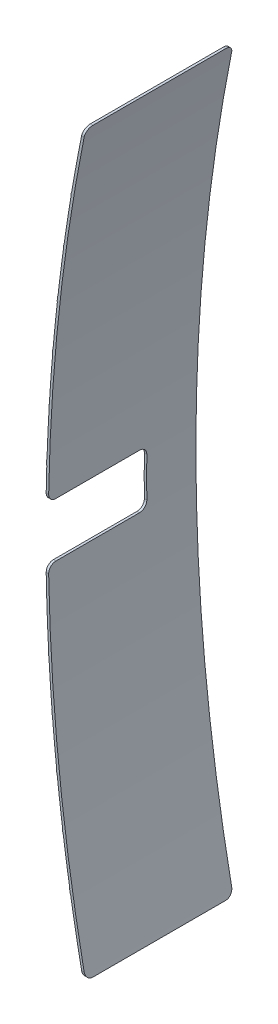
ISO-10303-21;
HEADER;
FILE_DESCRIPTION(('STEP AP214'),'2;1');
FILE_NAME('part.step','',(''),(''),'','','');
FILE_SCHEMA(('AUTOMOTIVE_DESIGN { 1 0 10303 214 1 1 1 1 }'));
ENDSEC;
DATA;
#1=APPLICATION_CONTEXT('core data for automotive mechanical design processes');
#2=APPLICATION_PROTOCOL_DEFINITION('international standard','automotive_design',2000,#1);
#3=PRODUCT_CONTEXT('',#1,'mechanical');
#4=PRODUCT('Part','Part','',(#3));
#5=PRODUCT_RELATED_PRODUCT_CATEGORY('part','',(#4));
#6=PRODUCT_DEFINITION_FORMATION('','',#4);
#7=PRODUCT_DEFINITION_CONTEXT('part definition',#1,'design');
#8=PRODUCT_DEFINITION('design','',#6,#7);
#9=PRODUCT_DEFINITION_SHAPE('','',#8);
#10=(LENGTH_UNIT() NAMED_UNIT(*) SI_UNIT(.MILLI.,.METRE.));
#11=(NAMED_UNIT(*) PLANE_ANGLE_UNIT() SI_UNIT($,.RADIAN.));
#12=(NAMED_UNIT(*) SI_UNIT($,.STERADIAN.) SOLID_ANGLE_UNIT());
#13=UNCERTAINTY_MEASURE_WITH_UNIT(LENGTH_MEASURE(1.E-05),#10,'distance_accuracy_value','');
#14=(GEOMETRIC_REPRESENTATION_CONTEXT(3) GLOBAL_UNCERTAINTY_ASSIGNED_CONTEXT((#13)) GLOBAL_UNIT_ASSIGNED_CONTEXT((#10,
#11,#12)) REPRESENTATION_CONTEXT('',''));
#15=CARTESIAN_POINT('',(0.,0.,0.));
#16=DIRECTION('',(0.,0.,1.));
#17=DIRECTION('',(1.,0.,0.));
#18=AXIS2_PLACEMENT_3D('',#15,#16,#17);
#19=CARTESIAN_POINT('',(0.,0.,6.));
#20=DIRECTION('',(0.,0.,-1.));
#21=DIRECTION('',(-1.,0.,0.));
#22=AXIS2_PLACEMENT_3D('',#19,#20,#21);
#23=CYLINDRICAL_SURFACE('',#22,75.1);
#24=CARTESIAN_POINT('',(0.,0.,6.));
#25=DIRECTION('',(0.,0.,1.));
#26=DIRECTION('',(1.,0.,0.));
#27=AXIS2_PLACEMENT_3D('',#24,#25,#26);
#28=CIRCLE('',#27,75.1);
#29=CARTESIAN_POINT('',(-75.0621160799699,2.38510578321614,6.));
#30=VERTEX_POINT('',#29);
#31=CARTESIAN_POINT('',(-75.0869495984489,1.4,6.));
#32=VERTEX_POINT('',#31);
#33=EDGE_CURVE('E1098',#30,#32,#28,.T.);
#34=ORIENTED_EDGE('',*,*,#33,.F.);
#35=DIRECTION('',(0.,0.,-1.));
#36=VECTOR('',#35,1.);
#37=CARTESIAN_POINT('',(-75.0621160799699,2.38510578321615,6.));
#38=LINE('',#37,#36);
#39=CARTESIAN_POINT('',(-75.0621160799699,2.38510578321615,2.));
#40=VERTEX_POINT('',#39);
#41=EDGE_CURVE('E961',#30,#40,#38,.T.);
#42=ORIENTED_EDGE('',*,*,#41,.T.);
#43=CARTESIAN_POINT('',(0.,0.,2.));
#44=DIRECTION('',(0.,0.,-1.));
#45=DIRECTION('',(-0.99940743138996,0.0344207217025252,0.));
#46=AXIS2_PLACEMENT_3D('',#43,#44,#45);
#47=CIRCLE('',#46,75.1);
#48=CARTESIAN_POINT('',(-75.055498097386,2.58499619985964,2.));
#49=VERTEX_POINT('',#48);
#50=EDGE_CURVE('E945',#40,#49,#47,.T.);
#51=ORIENTED_EDGE('',*,*,#50,.T.);
#52=DIRECTION('',(0.,0.,1.));
#53=VECTOR('',#52,1.);
#54=CARTESIAN_POINT('',(-75.055498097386,2.58499619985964,2.));
#55=LINE('',#54,#53);
#56=CARTESIAN_POINT('',(-75.055498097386,2.58499619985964,6.));
#57=VERTEX_POINT('',#56);
#58=EDGE_CURVE('E951',#49,#57,#55,.T.);
#59=ORIENTED_EDGE('',*,*,#58,.T.);
#60=CARTESIAN_POINT('',(-74.9719893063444,4.38301488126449,6.));
#61=VERTEX_POINT('',#60);
#62=EDGE_CURVE('E977',#61,#57,#28,.T.);
#63=ORIENTED_EDGE('',*,*,#62,.F.);
#64=DIRECTION('',(0.,0.,-1.));
#65=VECTOR('',#64,1.);
#66=CARTESIAN_POINT('',(-74.9719893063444,4.3830148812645,5.99999999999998));
#67=LINE('',#66,#65);
#68=CARTESIAN_POINT('',(-74.9719893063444,4.3830148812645,1.99999999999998));
#69=VERTEX_POINT('',#68);
#70=EDGE_CURVE('E957',#61,#69,#67,.T.);
#71=ORIENTED_EDGE('',*,*,#70,.T.);
#72=CARTESIAN_POINT('',(0.,0.,1.99999999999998));
#73=DIRECTION('',(0.,0.,-1.));
#74=DIRECTION('',(-0.998136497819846,0.0610207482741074,0.));
#75=AXIS2_PLACEMENT_3D('',#72,#73,#74);
#76=CIRCLE('',#75,75.1);
#77=CARTESIAN_POINT('',(-74.9600509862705,4.58265819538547,1.99999999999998));
#78=VERTEX_POINT('',#77);
#79=EDGE_CURVE('E1004',#69,#78,#76,.T.);
#80=ORIENTED_EDGE('',*,*,#79,.T.);
#81=DIRECTION('',(0.,0.,1.));
#82=VECTOR('',#81,1.);
#83=CARTESIAN_POINT('',(-74.9600509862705,4.58265819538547,1.99999999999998));
#84=LINE('',#83,#82);
#85=CARTESIAN_POINT('',(-74.9600509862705,4.58265819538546,6.));
#86=VERTEX_POINT('',#85);
#87=EDGE_CURVE('E999',#78,#86,#84,.T.);
#88=ORIENTED_EDGE('',*,*,#87,.T.);
#89=CARTESIAN_POINT('',(-74.8286941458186,6.37781564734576,6.));
#90=VERTEX_POINT('',#89);
#91=EDGE_CURVE('E988',#90,#86,#28,.T.);
#92=ORIENTED_EDGE('',*,*,#91,.F.);
#93=DIRECTION('',(0.,0.,-1.));
#94=VECTOR('',#93,1.);
#95=CARTESIAN_POINT('',(-74.8286941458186,6.37781564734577,5.99999999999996));
#96=LINE('',#95,#94);
#97=CARTESIAN_POINT('',(-74.8286941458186,6.37781564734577,1.99999999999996));
#98=VERTEX_POINT('',#97);
#99=EDGE_CURVE('E1003',#90,#98,#96,.T.);
#100=ORIENTED_EDGE('',*,*,#99,.T.);
#101=CARTESIAN_POINT('',(0.,0.,1.99999999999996));
#102=DIRECTION('',(0.,0.,-1.));
#103=DIRECTION('',(-0.996157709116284,0.0875775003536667,0.));
#104=AXIS2_PLACEMENT_3D('',#101,#102,#103);
#105=CIRCLE('',#104,75.1);
#106=CARTESIAN_POINT('',(-74.8114439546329,6.57707027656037,1.99999999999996));
#107=VERTEX_POINT('',#106);
#108=EDGE_CURVE('E1041',#98,#107,#105,.T.);
#109=ORIENTED_EDGE('',*,*,#108,.T.);
#110=DIRECTION('',(0.,0.,1.));
#111=VECTOR('',#110,1.);
#112=CARTESIAN_POINT('',(-74.8114439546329,6.57707027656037,1.99999999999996));
#113=LINE('',#112,#111);
#114=CARTESIAN_POINT('',(-74.8114439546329,6.57707027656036,6.));
#115=VERTEX_POINT('',#114);
#116=EDGE_CURVE('E1037',#107,#115,#113,.T.);
#117=ORIENTED_EDGE('',*,*,#116,.T.);
#118=CARTESIAN_POINT('',(-74.6323322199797,8.36809341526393,6.));
#119=VERTEX_POINT('',#118);
#120=EDGE_CURVE('E1026',#119,#115,#28,.T.);
#121=ORIENTED_EDGE('',*,*,#120,.F.);
#122=DIRECTION('',(0.,0.,-1.));
#123=VECTOR('',#122,1.);
#124=CARTESIAN_POINT('',(-74.6323322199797,8.36809341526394,5.99999999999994));
#125=LINE('',#124,#123);
#126=CARTESIAN_POINT('',(-74.6323322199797,8.36809341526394,1.99999999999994));
#127=VERTEX_POINT('',#126);
#128=EDGE_CURVE('E530',#119,#127,#125,.T.);
#129=ORIENTED_EDGE('',*,*,#128,.T.);
#130=CARTESIAN_POINT('',(0.,0.,1.99999999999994));
#131=DIRECTION('',(0.,0.,-1.));
#132=DIRECTION('',(-0.993472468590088,0.114072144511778,0.));
#133=AXIS2_PLACEMENT_3D('',#130,#131,#132);
#134=CIRCLE('',#133,75.1);
#135=CARTESIAN_POINT('',(-74.6097823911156,8.56681805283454,1.99999999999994));
#136=VERTEX_POINT('',#135);
#137=EDGE_CURVE('E1076',#127,#136,#134,.T.);
#138=ORIENTED_EDGE('',*,*,#137,.T.);
#139=DIRECTION('',(0.,0.,1.));
#140=VECTOR('',#139,1.);
#141=CARTESIAN_POINT('',(-74.6097823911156,8.56681805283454,1.99999999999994));
#142=LINE('',#141,#140);
#143=CARTESIAN_POINT('',(-74.6097823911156,8.56681805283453,6.));
#144=VERTEX_POINT('',#143);
#145=EDGE_CURVE('E1072',#136,#144,#142,.T.);
#146=ORIENTED_EDGE('',*,*,#145,.T.);
#147=CARTESIAN_POINT('',(-74.3830427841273,10.3524367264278,6.));
#148=VERTEX_POINT('',#147);
#149=EDGE_CURVE('E1062',#148,#144,#28,.T.);
#150=ORIENTED_EDGE('',*,*,#149,.F.);
#151=DIRECTION('',(0.,0.,-1.));
#152=VECTOR('',#151,1.);
#153=CARTESIAN_POINT('',(-74.3830427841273,10.3524367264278,5.99999999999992));
#154=LINE('',#153,#152);
#155=CARTESIAN_POINT('',(-74.3830427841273,10.3524367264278,1.99999999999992));
#156=VERTEX_POINT('',#155);
#157=EDGE_CURVE('E1075',#148,#156,#154,.T.);
#158=ORIENTED_EDGE('',*,*,#157,.T.);
#159=CARTESIAN_POINT('',(0.,0.,1.99999999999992));
#160=DIRECTION('',(0.,0.,-1.));
#161=DIRECTION('',(-0.990082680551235,0.140485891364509,0.));
#162=AXIS2_PLACEMENT_3D('',#159,#160,#161);
#163=CIRCLE('',#162,75.1);
#164=CARTESIAN_POINT('',(-74.3552093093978,10.5504904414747,1.99999999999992));
#165=VERTEX_POINT('',#164);
#166=EDGE_CURVE('E1655',#156,#165,#163,.T.);
#167=ORIENTED_EDGE('',*,*,#166,.T.);
#168=DIRECTION('',(0.,0.,1.));
#169=VECTOR('',#168,1.);
#170=CARTESIAN_POINT('',(-74.3552093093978,10.5504904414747,1.99999999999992));
#171=LINE('',#170,#169);
#172=CARTESIAN_POINT('',(-74.3552093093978,10.5504904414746,6.));
#173=VERTEX_POINT('',#172);
#174=EDGE_CURVE('E1232',#165,#173,#171,.T.);
#175=ORIENTED_EDGE('',*,*,#174,.T.);
#176=CARTESIAN_POINT('',(-74.0810026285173,12.3294383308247,6.));
#177=VERTEX_POINT('',#176);
#178=EDGE_CURVE('E1094',#177,#173,#28,.T.);
#179=ORIENTED_EDGE('',*,*,#178,.F.);
#180=DIRECTION('',(0.,0.,-1.));
#181=VECTOR('',#180,1.);
#182=CARTESIAN_POINT('',(-74.0810026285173,12.3294383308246,5.9999999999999));
#183=LINE('',#182,#181);
#184=CARTESIAN_POINT('',(-74.0810026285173,12.3294383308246,1.9999999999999));
#185=VERTEX_POINT('',#184);
#186=EDGE_CURVE('E1229',#177,#185,#183,.T.);
#187=ORIENTED_EDGE('',*,*,#186,.T.);
#188=CARTESIAN_POINT('',(0.,0.,1.9999999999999));
#189=DIRECTION('',(0.,0.,-1.));
#190=DIRECTION('',(-0.985990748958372,0.166800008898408,0.));
#191=AXIS2_PLACEMENT_3D('',#188,#189,#190);
#192=CIRCLE('',#191,75.1);
#193=CARTESIAN_POINT('',(-74.0479052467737,12.5266806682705,1.9999999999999));
#194=VERTEX_POINT('',#193);
#195=EDGE_CURVE('E1225',#185,#194,#192,.T.);
#196=ORIENTED_EDGE('',*,*,#195,.T.);
#197=DIRECTION('',(0.,0.,1.));
#198=VECTOR('',#197,1.);
#199=CARTESIAN_POINT('',(-74.0479052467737,12.5266806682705,1.9999999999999));
#200=LINE('',#199,#198);
#201=CARTESIAN_POINT('',(-74.0479052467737,12.5266806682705,6.));
#202=VERTEX_POINT('',#201);
#203=EDGE_CURVE('E1220',#194,#202,#200,.T.);
#204=ORIENTED_EDGE('',*,*,#203,.T.);
#205=CARTESIAN_POINT('',(-73.6472674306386,14.7,6.));
#206=VERTEX_POINT('',#205);
#207=EDGE_CURVE('E1112',#206,#202,#28,.T.);
#208=ORIENTED_EDGE('',*,*,#207,.F.);
#209=CARTESIAN_POINT('',(-73.6472674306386,14.7,6.));
#210=CARTESIAN_POINT('',(-73.6438482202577,14.717131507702,6.00001312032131));
#211=CARTESIAN_POINT('',(-73.6404230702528,14.7342592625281,5.9985332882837));
#212=CARTESIAN_POINT('',(-73.6336583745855,14.7680276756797,5.99268357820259));
#213=CARTESIAN_POINT('',(-73.6303188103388,14.7846684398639,5.98831433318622));
#214=CARTESIAN_POINT('',(-73.6238190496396,14.8170018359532,5.97677778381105));
#215=CARTESIAN_POINT('',(-73.6206589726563,14.8326938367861,5.9696086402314));
#216=CARTESIAN_POINT('',(-73.6146162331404,14.8626548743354,5.95266440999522));
#217=CARTESIAN_POINT('',(-73.6117334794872,14.8769243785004,5.94289018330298));
#218=CARTESIAN_POINT('',(-73.6063581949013,14.9034967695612,5.92109232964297));
#219=CARTESIAN_POINT('',(-73.6038624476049,14.915815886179,5.90908929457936));
#220=CARTESIAN_POINT('',(-73.5993106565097,14.9382596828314,5.88310374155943));
#221=CARTESIAN_POINT('',(-73.5972546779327,14.9483840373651,5.86912093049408));
#222=CARTESIAN_POINT('',(-73.5936860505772,14.9659430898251,5.83985755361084));
#223=CARTESIAN_POINT('',(-73.592163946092,14.9734246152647,5.82460620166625));
#224=CARTESIAN_POINT('',(-73.5896624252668,14.9857139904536,5.79302656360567));
#225=CARTESIAN_POINT('',(-73.5886825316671,14.9905241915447,5.77669923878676));
#226=CARTESIAN_POINT('',(-73.5875785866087,14.9959421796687,5.75020230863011));
#227=CARTESIAN_POINT('',(-73.5872686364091,14.997462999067,5.74021802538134));
#228=CARTESIAN_POINT('',(-73.5868551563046,14.9994916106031,5.72015741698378));
#229=CARTESIAN_POINT('',(-73.5867513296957,15.0000008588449,5.71008124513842));
#230=CARTESIAN_POINT('',(-73.5867515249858,15.0000000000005,5.7000000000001));
#231=B_SPLINE_CURVE_WITH_KNOTS('',3,(#209,#210,#211,#212,#213,#214,#215,#216,#217,#218,#219,
#220,#221,#222,#223,#224,#225,#226,#227,#228,#229,#230),.UNSPECIFIED.,.F.,.F.,(4,2,2,2,2,2,2,2,
2,2,4),(0.,0.0523423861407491,0.104673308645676,0.15703866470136,0.209386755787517,
0.261273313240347,0.31316756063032,0.364089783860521,0.414967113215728,0.445231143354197,
0.475451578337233),.UNSPECIFIED.);
#232=CARTESIAN_POINT('',(-73.5867515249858,15.,5.7));
#233=VERTEX_POINT('',#232);
#234=EDGE_CURVE('E1224',#206,#233,#231,.T.);
#235=ORIENTED_EDGE('',*,*,#234,.T.);
#236=DIRECTION('',(0.,0.,-1.));
#237=VECTOR('',#236,1.);
#238=CARTESIAN_POINT('',(-73.5867515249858,15.,6.));
#239=LINE('',#238,#237);
#240=CARTESIAN_POINT('',(-73.5867515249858,15.,0.3));
#241=VERTEX_POINT('',#240);
#242=EDGE_CURVE('E1973',#233,#241,#239,.T.);
#243=ORIENTED_EDGE('',*,*,#242,.T.);
#244=CARTESIAN_POINT('',(-73.5867515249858,15.,0.3));
#245=CARTESIAN_POINT('',(-73.586748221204,15.0000154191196,0.283366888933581));
#246=CARTESIAN_POINT('',(-73.5870332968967,14.9986176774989,0.266740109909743));
#247=CARTESIAN_POINT('',(-73.5881553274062,14.9931120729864,0.233982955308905));
#248=CARTESIAN_POINT('',(-73.5889915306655,14.9890079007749,0.217851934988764));
#249=CARTESIAN_POINT('',(-73.5911913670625,14.9782035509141,0.186517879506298));
#250=CARTESIAN_POINT('',(-73.5925551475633,14.9715026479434,0.171315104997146));
#251=CARTESIAN_POINT('',(-73.5957647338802,14.9557172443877,0.14226006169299));
#252=CARTESIAN_POINT('',(-73.5976105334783,14.9466327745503,0.12840777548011));
#253=CARTESIAN_POINT('',(-73.6017449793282,14.9262602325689,0.102306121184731));
#254=CARTESIAN_POINT('',(-73.604037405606,14.9149533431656,0.0900720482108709));
#255=CARTESIAN_POINT('',(-73.6089848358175,14.89051733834,0.0676683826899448));
#256=CARTESIAN_POINT('',(-73.6116399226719,14.8773878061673,0.0574992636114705));
#257=CARTESIAN_POINT('',(-73.6172883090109,14.8494130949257,0.0393096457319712));
#258=CARTESIAN_POINT('',(-73.6202871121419,14.8345398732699,0.031334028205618));
#259=CARTESIAN_POINT('',(-73.626493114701,14.8037075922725,0.0179953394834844));
#260=CARTESIAN_POINT('',(-73.6297002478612,14.7877488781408,0.012631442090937));
#261=CARTESIAN_POINT('',(-73.6353121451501,14.7597746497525,0.005768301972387));
#262=CARTESIAN_POINT('',(-73.6376890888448,14.7479114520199,0.00360658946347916));
#263=CARTESIAN_POINT('',(-73.6424672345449,14.7240337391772,0.000722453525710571));
#264=CARTESIAN_POINT('',(-73.6448683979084,14.7120194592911,-1.98166244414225E-06));
#265=CARTESIAN_POINT('',(-73.6472674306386,14.7,0.));
#266=B_SPLINE_CURVE_WITH_KNOTS('',3,(#244,#245,#246,#247,#248,#249,#250,#251,#252,#253,#254,
#255,#256,#257,#258,#259,#260,#261,#262,#263,#264,#265),.UNSPECIFIED.,.F.,.F.,(4,2,2,2,2,2,2,2,
2,2,4),(0.,0.0498288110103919,0.099589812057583,0.149364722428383,0.199138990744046,
0.24935441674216,0.299581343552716,0.350770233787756,0.40194292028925,0.438733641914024,
0.47547283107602),.UNSPECIFIED.);
#267=CARTESIAN_POINT('',(-73.6472674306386,14.7,0.));
#268=VERTEX_POINT('',#267);
#269=EDGE_CURVE('E1823',#241,#268,#266,.T.);
#270=ORIENTED_EDGE('',*,*,#269,.T.);
#271=CARTESIAN_POINT('',(0.,0.,0.));
#272=DIRECTION('',(0.,0.,1.));
#273=DIRECTION('',(1.,0.,0.));
#274=AXIS2_PLACEMENT_3D('',#271,#272,#273);
#275=CIRCLE('',#274,75.1);
#276=CARTESIAN_POINT('',(-75.0342512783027,3.14183626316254,0.));
#277=VERTEX_POINT('',#276);
#278=EDGE_CURVE('E1569',#268,#277,#275,.T.);
#279=ORIENTED_EDGE('',*,*,#278,.T.);
#280=CARTESIAN_POINT('',(-75.0998643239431,0.142753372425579,2.));
#281=CARTESIAN_POINT('',(-75.0979634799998,1.14275161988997,1.33333329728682));
#282=CARTESIAN_POINT('',(-75.0760866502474,2.14271169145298,0.666666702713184));
#283=CARTESIAN_POINT('',(-75.0342512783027,3.14183626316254,0.));
#284=B_SPLINE_CURVE_WITH_KNOTS('',3,(#280,#281,#282,#283),.UNSPECIFIED.,.F.,.F.,(4,4),(0.,1.),.UNSPECIFIED.);
#285=CARTESIAN_POINT('',(-75.0998643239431,0.142753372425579,2.));
#286=VERTEX_POINT('',#285);
#287=EDGE_CURVE('E1578',#277,#286,#284,.F.);
#288=ORIENTED_EDGE('',*,*,#287,.T.);
#289=CARTESIAN_POINT('',(0.,0.,2.));
#290=DIRECTION('',(0.,0.,-1.));
#291=DIRECTION('',(-1.,0.,0.));
#292=AXIS2_PLACEMENT_3D('',#289,#290,#291);
#293=CIRCLE('',#292,75.1);
#294=CARTESIAN_POINT('',(-75.0957388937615,0.8,2.));
#295=VERTEX_POINT('',#294);
#296=EDGE_CURVE('E1587',#286,#295,#293,.T.);
#297=ORIENTED_EDGE('',*,*,#296,.T.);
#298=CARTESIAN_POINT('',(-75.0957388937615,0.8,2.));
#299=CARTESIAN_POINT('',(-75.0955593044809,0.816878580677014,1.99998567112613));
#300=CARTESIAN_POINT('',(-75.0953736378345,0.833752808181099,2.00142357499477));
#301=CARTESIAN_POINT('',(-75.0949969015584,0.867010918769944,2.00709804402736));
#302=CARTESIAN_POINT('',(-75.0948058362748,0.883395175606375,2.01133241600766));
#303=CARTESIAN_POINT('',(-75.094424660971,0.915227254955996,2.0224969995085));
#304=CARTESIAN_POINT('',(-75.0942345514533,0.93067462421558,2.02942850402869));
#305=CARTESIAN_POINT('',(-75.0938630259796,0.960183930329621,2.04578458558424));
#306=CARTESIAN_POINT('',(-75.093681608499,0.974246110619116,2.0552087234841));
#307=CARTESIAN_POINT('',(-75.0933352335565,1.00058858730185,2.07628412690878));
#308=CARTESIAN_POINT('',(-75.0931702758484,1.01286891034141,2.08793535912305));
#309=CARTESIAN_POINT('',(-75.0928643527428,1.03530162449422,2.11313711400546));
#310=CARTESIAN_POINT('',(-75.092723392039,1.04545359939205,2.12668800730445));
#311=CARTESIAN_POINT('',(-75.092472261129,1.06333909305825,2.1553025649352));
#312=CARTESIAN_POINT('',(-75.0923620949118,1.07107229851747,2.17036642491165));
#313=CARTESIAN_POINT('',(-75.0921780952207,1.08389588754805,2.20157587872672));
#314=CARTESIAN_POINT('',(-75.0921042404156,1.08898782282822,2.21772083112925));
#315=CARTESIAN_POINT('',(-75.0920150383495,1.09511796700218,2.2449706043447));
#316=CARTESIAN_POINT('',(-75.0919883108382,1.09694762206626,2.25590389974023));
#317=CARTESIAN_POINT('',(-75.0919526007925,1.09938847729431,2.27788993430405));
#318=CARTESIAN_POINT('',(-75.0919435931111,1.10000140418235,2.28894248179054));
#319=CARTESIAN_POINT('',(-75.0919436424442,1.10000000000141,2.29999999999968));
#320=B_SPLINE_CURVE_WITH_KNOTS('',3,(#298,#299,#300,#301,#302,#303,#304,#305,#306,#307,#308,
#309,#310,#311,#312,#313,#314,#315,#316,#317,#318,#319),.UNSPECIFIED.,.F.,.F.,(4,2,2,2,2,2,2,2,
2,2,4),(0.,0.0505713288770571,0.101103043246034,0.151659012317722,0.202206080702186,
0.25275239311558,0.303308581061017,0.353871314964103,0.404404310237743,0.437597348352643,
0.470743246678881),.UNSPECIFIED.);
#321=CARTESIAN_POINT('',(-75.0919436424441,1.1,2.3));
#322=VERTEX_POINT('',#321);
#323=EDGE_CURVE('E2590',#295,#322,#320,.T.);
#324=ORIENTED_EDGE('',*,*,#323,.T.);
#325=DIRECTION('',(0.,0.,-1.));
#326=VECTOR('',#325,1.);
#327=CARTESIAN_POINT('',(-75.0919436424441,1.1,6.));
#328=LINE('',#327,#326);
#329=CARTESIAN_POINT('',(-75.0919436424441,1.1,5.7));
#330=VERTEX_POINT('',#329);
#331=EDGE_CURVE('E1131',#322,#330,#328,.F.);
#332=ORIENTED_EDGE('',*,*,#331,.T.);
#333=CARTESIAN_POINT('',(-75.0919436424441,1.1,5.7));
#334=CARTESIAN_POINT('',(-75.091943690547,1.09998565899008,5.71687606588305));
#335=CARTESIAN_POINT('',(-75.0919227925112,1.10142314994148,5.73374784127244));
#336=CARTESIAN_POINT('',(-75.0918394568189,1.10709596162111,5.76700116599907));
#337=CARTESIAN_POINT('',(-75.0917770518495,1.11132908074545,5.78338309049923));
#338=CARTESIAN_POINT('',(-75.0916110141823,1.12249029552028,5.81521072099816));
#339=CARTESIAN_POINT('',(-75.0915073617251,1.12941968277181,5.8306559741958));
#340=CARTESIAN_POINT('',(-75.0912596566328,1.14577057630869,5.8601613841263));
#341=CARTESIAN_POINT('',(-75.091115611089,1.15519164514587,5.87422178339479));
#342=CARTESIAN_POINT('',(-75.0907885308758,1.17626032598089,5.90056181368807));
#343=CARTESIAN_POINT('',(-75.0906054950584,1.18790800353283,5.9128413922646));
#344=CARTESIAN_POINT('',(-75.0902027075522,1.21310170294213,5.93527326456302));
#345=CARTESIAN_POINT('',(-75.0899829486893,1.22664809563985,5.94542514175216));
#346=CARTESIAN_POINT('',(-75.089510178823,1.25525519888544,5.96331298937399));
#347=CARTESIAN_POINT('',(-75.0892571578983,1.27031636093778,5.97104823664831));
#348=CARTESIAN_POINT('',(-75.0887227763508,1.30152011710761,5.98387644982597));
#349=CARTESIAN_POINT('',(-75.0884414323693,1.31766207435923,5.98897095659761));
#350=CARTESIAN_POINT('',(-75.0879571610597,1.34491880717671,5.99510870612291));
#351=CARTESIAN_POINT('',(-75.0877603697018,1.35586235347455,5.9969418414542));
#352=CARTESIAN_POINT('',(-75.0873597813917,1.37786908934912,5.99938732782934));
#353=CARTESIAN_POINT('',(-75.087155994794,1.388932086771,6.00000141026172));
#354=CARTESIAN_POINT('',(-75.0869495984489,1.39999999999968,6.00000000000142));
#355=B_SPLINE_CURVE_WITH_KNOTS('',3,(#333,#334,#335,#336,#337,#338,#339,#340,#341,#342,#343,
#344,#345,#346,#347,#348,#349,#350,#351,#352,#353,#354),.UNSPECIFIED.,.F.,.F.,(4,2,2,2,2,2,2,2,
2,2,4),(0.,0.0505609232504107,0.101082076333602,0.151627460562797,0.202163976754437,
0.252701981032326,0.303249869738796,0.353812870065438,0.404346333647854,0.437576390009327,
0.470759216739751),.UNSPECIFIED.);
#356=EDGE_CURVE('E1123',#330,#32,#355,.T.);
#357=ORIENTED_EDGE('',*,*,#356,.T.);
#358=EDGE_LOOP('',(#34,#42,#51,#59,#63,#71,#80,#88,#92,#100,#109,#117,#121,#129,#138,#146,#150,
#158,#167,#175,#179,#187,#196,#204,#208,#235,#243,#270,#279,#288,#297,#324,#332,#357));
#359=FACE_BOUND('',#358,.T.);
#360=ADVANCED_FACE('F526',(#359),#23,.T.);
#361=CARTESIAN_POINT('',(0.,0.,6.));
#362=DIRECTION('',(0.,0.,1.));
#363=DIRECTION('',(1.,0.,0.));
#364=AXIS2_PLACEMENT_3D('',#361,#362,#363);
#365=PLANE('',#364);
#366=ORIENTED_EDGE('',*,*,#207,.T.);
#367=DIRECTION('',(0.985990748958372,-0.166800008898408,0.));
#368=VECTOR('',#367,1.);
#369=CARTESIAN_POINT('',(-74.0479052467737,12.5266806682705,6.));
#370=LINE('',#369,#368);
#371=CARTESIAN_POINT('',(-74.0577651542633,12.5283486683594,6.));
#372=VERTEX_POINT('',#371);
#373=EDGE_CURVE('E1201',#372,#202,#370,.T.);
#374=ORIENTED_EDGE('',*,*,#373,.F.);
#375=CARTESIAN_POINT('',(0.,0.,6.));
#376=DIRECTION('',(0.,0.,-1.));
#377=DIRECTION('',(-1.,0.,0.));
#378=AXIS2_PLACEMENT_3D('',#375,#376,#377);
#379=CIRCLE('',#378,75.11);
#380=CARTESIAN_POINT('',(-74.090866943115,12.3310800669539,6.));
#381=VERTEX_POINT('',#380);
#382=EDGE_CURVE('E1122',#372,#381,#379,.F.);
#383=ORIENTED_EDGE('',*,*,#382,.T.);
#384=DIRECTION('',(0.986431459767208,-0.164173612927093,0.));
#385=VECTOR('',#384,1.);
#386=CARTESIAN_POINT('',(-74.0810026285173,12.3294383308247,6.));
#387=LINE('',#386,#385);
#388=EDGE_CURVE('E1129',#381,#177,#387,.T.);
#389=ORIENTED_EDGE('',*,*,#388,.T.);
#390=ORIENTED_EDGE('',*,*,#178,.T.);
#391=DIRECTION('',(0.990082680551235,-0.140485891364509,0.));
#392=VECTOR('',#391,1.);
#393=CARTESIAN_POINT('',(-74.3552093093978,10.5504904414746,6.));
#394=LINE('',#393,#392);
#395=CARTESIAN_POINT('',(-74.3651101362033,10.5518953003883,6.));
#396=VERTEX_POINT('',#395);
#397=EDGE_CURVE('E1065',#396,#173,#394,.T.);
#398=ORIENTED_EDGE('',*,*,#397,.F.);
#399=CARTESIAN_POINT('',(0.,0.,6.));
#400=DIRECTION('',(0.,0.,-1.));
#401=DIRECTION('',(-1.,0.,0.));
#402=AXIS2_PLACEMENT_3D('',#399,#400,#401);
#403=CIRCLE('',#402,75.11);
#404=CARTESIAN_POINT('',(-74.3929473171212,10.3538152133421,6.));
#405=VERTEX_POINT('',#404);
#406=EDGE_CURVE('E1192',#396,#405,#403,.F.);
#407=ORIENTED_EDGE('',*,*,#406,.T.);
#408=DIRECTION('',(0.990453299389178,-0.137848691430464,0.));
#409=VECTOR('',#408,1.);
#410=CARTESIAN_POINT('',(-74.3830427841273,10.3524367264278,6.));
#411=LINE('',#410,#409);
#412=EDGE_CURVE('E1093',#405,#148,#411,.T.);
#413=ORIENTED_EDGE('',*,*,#412,.T.);
#414=ORIENTED_EDGE('',*,*,#149,.T.);
#415=DIRECTION('',(0.993472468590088,-0.114072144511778,0.));
#416=VECTOR('',#415,1.);
#417=CARTESIAN_POINT('',(-74.6097823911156,8.56681805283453,6.));
#418=LINE('',#417,#416);
#419=CARTESIAN_POINT('',(-74.6197171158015,8.56795877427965,6.));
#420=VERTEX_POINT('',#419);
#421=EDGE_CURVE('E1030',#420,#144,#418,.T.);
#422=ORIENTED_EDGE('',*,*,#421,.F.);
#423=CARTESIAN_POINT('',(0.,0.,6.));
#424=DIRECTION('',(0.,0.,-1.));
#425=DIRECTION('',(-1.,0.,0.));
#426=AXIS2_PLACEMENT_3D('',#423,#424,#425);
#427=CIRCLE('',#426,75.11);
#428=CARTESIAN_POINT('',(-74.6422699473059,8.36920767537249,6.));
#429=VERTEX_POINT('',#428);
#430=EDGE_CURVE('E1053',#420,#429,#427,.F.);
#431=ORIENTED_EDGE('',*,*,#430,.T.);
#432=DIRECTION('',(0.993772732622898,-0.111426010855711,0.));
#433=VECTOR('',#432,1.);
#434=CARTESIAN_POINT('',(-74.6323322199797,8.36809341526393,6.));
#435=LINE('',#434,#433);
#436=EDGE_CURVE('E1051',#429,#119,#435,.T.);
#437=ORIENTED_EDGE('',*,*,#436,.T.);
#438=ORIENTED_EDGE('',*,*,#120,.T.);
#439=DIRECTION('',(0.996157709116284,-0.0875775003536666,0.));
#440=VECTOR('',#439,1.);
#441=CARTESIAN_POINT('',(-74.8114439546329,6.57707027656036,6.));
#442=LINE('',#441,#440);
#443=CARTESIAN_POINT('',(-74.8214055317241,6.57794605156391,6.));
#444=VERTEX_POINT('',#443);
#445=EDGE_CURVE('E992',#444,#115,#442,.T.);
#446=ORIENTED_EDGE('',*,*,#445,.F.);
#447=CARTESIAN_POINT('',(0.,0.,6.));
#448=DIRECTION('',(0.,0.,-1.));
#449=DIRECTION('',(-1.,0.,0.));
#450=AXIS2_PLACEMENT_3D('',#447,#448,#449);
#451=CIRCLE('',#450,75.11);
#452=CARTESIAN_POINT('',(-74.8386580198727,6.37866489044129,6.));
#453=VERTEX_POINT('',#452);
#454=EDGE_CURVE('E1016',#444,#453,#451,.F.);
#455=ORIENTED_EDGE('',*,*,#454,.T.);
#456=DIRECTION('',(0.99638740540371,-0.0849243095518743,0.));
#457=VECTOR('',#456,1.);
#458=CARTESIAN_POINT('',(-74.8286941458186,6.37781564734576,6.));
#459=LINE('',#458,#457);
#460=EDGE_CURVE('E1013',#453,#90,#459,.T.);
#461=ORIENTED_EDGE('',*,*,#460,.T.);
#462=ORIENTED_EDGE('',*,*,#91,.T.);
#463=DIRECTION('',(0.998136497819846,-0.0610207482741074,0.));
#464=VECTOR('',#463,1.);
#465=CARTESIAN_POINT('',(-74.9600509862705,4.58265819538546,6.));
#466=LINE('',#465,#464);
#467=CARTESIAN_POINT('',(-74.9700323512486,4.58326840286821,6.));
#468=VERTEX_POINT('',#467);
#469=EDGE_CURVE('E970',#468,#86,#466,.T.);
#470=ORIENTED_EDGE('',*,*,#469,.F.);
#471=CARTESIAN_POINT('',(0.,0.,6.));
#472=DIRECTION('',(0.,0.,-1.));
#473=DIRECTION('',(-1.,0.,0.));
#474=AXIS2_PLACEMENT_3D('',#471,#472,#473);
#475=CIRCLE('',#474,75.11);
#476=CARTESIAN_POINT('',(-74.981972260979,4.38359850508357,6.));
#477=VERTEX_POINT('',#476);
#478=EDGE_CURVE('E978',#468,#477,#475,.F.);
#479=ORIENTED_EDGE('',*,*,#478,.T.);
#480=DIRECTION('',(0.998295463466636,-0.0583623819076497,0.));
#481=VECTOR('',#480,1.);
#482=CARTESIAN_POINT('',(-74.9719893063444,4.38301488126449,6.));
#483=LINE('',#482,#481);
#484=EDGE_CURVE('E974',#477,#61,#483,.T.);
#485=ORIENTED_EDGE('',*,*,#484,.T.);
#486=ORIENTED_EDGE('',*,*,#62,.T.);
#487=DIRECTION('',(0.99940743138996,-0.0344207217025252,0.));
#488=VECTOR('',#487,1.);
#489=CARTESIAN_POINT('',(-75.055498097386,2.58499619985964,6.));
#490=LINE('',#489,#488);
#491=CARTESIAN_POINT('',(-75.0654921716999,2.58534040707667,6.));
#492=VERTEX_POINT('',#491);
#493=EDGE_CURVE('E13',#492,#57,#490,.T.);
#494=ORIENTED_EDGE('',*,*,#493,.F.);
#495=CARTESIAN_POINT('',(0.,0.,6.));
#496=DIRECTION('',(0.,0.,-1.));
#497=DIRECTION('',(-1.,0.,0.));
#498=AXIS2_PLACEMENT_3D('',#495,#496,#497);
#499=CIRCLE('',#498,75.11);
#500=CARTESIAN_POINT('',(-75.0721110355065,2.38542337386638,6.));
#501=VERTEX_POINT('',#500);
#502=EDGE_CURVE('E1097',#492,#501,#499,.F.);
#503=ORIENTED_EDGE('',*,*,#502,.T.);
#504=DIRECTION('',(0.999495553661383,-0.0317590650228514,0.));
#505=VECTOR('',#504,1.);
#506=CARTESIAN_POINT('',(-75.0621160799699,2.38510578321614,6.));
#507=LINE('',#506,#505);
#508=EDGE_CURVE('E1101',#501,#30,#507,.T.);
#509=ORIENTED_EDGE('',*,*,#508,.T.);
#510=ORIENTED_EDGE('',*,*,#33,.T.);
#511=DIRECTION('',(-1.,0.,0.));
#512=VECTOR('',#511,1.);
#513=CARTESIAN_POINT('',(-74.9919328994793,1.4,6.));
#514=LINE('',#513,#512);
#515=CARTESIAN_POINT('',(-74.9869321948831,1.4,6.));
#516=VERTEX_POINT('',#515);
#517=EDGE_CURVE('E1103',#32,#516,#514,.F.);
#518=ORIENTED_EDGE('',*,*,#517,.T.);
#519=CARTESIAN_POINT('',(0.,0.,6.));
#520=DIRECTION('',(0.,0.,-1.));
#521=DIRECTION('',(1.,0.,0.));
#522=AXIS2_PLACEMENT_3D('',#519,#520,#521);
#523=CIRCLE('',#522,75.);
#524=CARTESIAN_POINT('',(-73.54529216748,14.7,6.));
#525=VERTEX_POINT('',#524);
#526=EDGE_CURVE('E1106',#516,#525,#523,.T.);
#527=ORIENTED_EDGE('',*,*,#526,.T.);
#528=DIRECTION('',(-1.,0.,0.));
#529=VECTOR('',#528,1.);
#530=CARTESIAN_POINT('',(-73.5867515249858,14.7,6.));
#531=LINE('',#530,#529);
#532=EDGE_CURVE('E1454',#525,#206,#531,.T.);
#533=ORIENTED_EDGE('',*,*,#532,.T.);
#534=EDGE_LOOP('',(#366,#374,#383,#389,#390,#398,#407,#413,#414,#422,#431,#437,#438,#446,#455,
#461,#462,#470,#479,#485,#486,#494,#503,#509,#510,#518,#527,#533));
#535=FACE_BOUND('',#534,.T.);
#536=ADVANCED_FACE('F1432',(#535),#365,.T.);
#537=CARTESIAN_POINT('',(0.,0.,6.));
#538=DIRECTION('',(0.,0.,-1.));
#539=DIRECTION('',(-1.,0.,0.));
#540=AXIS2_PLACEMENT_3D('',#537,#538,#539);
#541=CYLINDRICAL_SURFACE('',#540,75.);
#542=ORIENTED_EDGE('',*,*,#526,.F.);
#543=CARTESIAN_POINT('',(-74.9869321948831,1.4,6.));
#544=CARTESIAN_POINT('',(-74.9872475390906,1.38312127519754,6.00001432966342));
#545=CARTESIAN_POINT('',(-74.9875566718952,1.36624668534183,5.99857639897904));
#546=CARTESIAN_POINT('',(-74.9881551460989,1.33298740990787,5.99290161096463));
#547=CARTESIAN_POINT('',(-74.988444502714,1.31660235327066,5.98866693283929));
#548=CARTESIAN_POINT('',(-74.9889967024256,1.28476835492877,5.97750124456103));
#549=CARTESIAN_POINT('',(-74.9892595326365,1.26931986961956,5.97056893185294));
#550=CARTESIAN_POINT('',(-74.989753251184,1.23980834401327,5.95421064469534));
#551=CARTESIAN_POINT('',(-74.9899841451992,1.2257450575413,5.94478511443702));
#552=CARTESIAN_POINT('',(-74.9904101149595,1.19940185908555,5.92370732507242));
#553=CARTESIAN_POINT('',(-74.9906051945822,1.1871217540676,5.91205530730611));
#554=CARTESIAN_POINT('',(-74.9909569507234,1.16468955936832,5.88685182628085));
#555=CARTESIAN_POINT('',(-74.9911136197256,1.15453788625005,5.87329999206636));
#556=CARTESIAN_POINT('',(-74.9913868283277,1.13665380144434,5.84468444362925));
#557=CARTESIAN_POINT('',(-74.9915033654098,1.12892154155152,5.8296206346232));
#558=CARTESIAN_POINT('',(-74.991695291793,1.11609974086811,5.7984114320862));
#559=CARTESIAN_POINT('',(-74.9917707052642,1.11100864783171,5.78226668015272));
#560=CARTESIAN_POINT('',(-74.991861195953,1.10488019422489,5.75501911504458));
#561=CARTESIAN_POINT('',(-74.9918880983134,1.10305122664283,5.74408782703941));
#562=CARTESIAN_POINT('',(-74.9919239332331,1.100611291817,5.72210588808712));
#563=CARTESIAN_POINT('',(-74.9919328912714,1.09999859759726,5.71105542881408));
#564=CARTESIAN_POINT('',(-74.9919328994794,1.09999999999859,5.70000000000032));
#565=B_SPLINE_CURVE_WITH_KNOTS('',3,(#543,#544,#545,#546,#547,#548,#549,#550,#551,#552,#553,
#554,#555,#556,#557,#558,#559,#560,#561,#562,#563,#564),.UNSPECIFIED.,.F.,.F.,(4,2,2,2,2,2,2,2,
2,2,4),(0.,0.050577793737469,0.101116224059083,0.151679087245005,0.202232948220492,
0.252781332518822,0.303339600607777,0.353901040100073,0.404432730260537,0.437619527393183,
0.470759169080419),.UNSPECIFIED.);
#566=CARTESIAN_POINT('',(-74.9919328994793,1.1,5.7));
#567=VERTEX_POINT('',#566);
#568=EDGE_CURVE('E1443',#516,#567,#565,.T.);
#569=ORIENTED_EDGE('',*,*,#568,.T.);
#570=DIRECTION('',(0.,0.,-1.));
#571=VECTOR('',#570,1.);
#572=CARTESIAN_POINT('',(-74.9919328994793,1.1,6.));
#573=LINE('',#572,#571);
#574=CARTESIAN_POINT('',(-74.9919328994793,1.1,2.3));
#575=VERTEX_POINT('',#574);
#576=EDGE_CURVE('E1480',#567,#575,#573,.T.);
#577=ORIENTED_EDGE('',*,*,#576,.T.);
#578=CARTESIAN_POINT('',(-74.9919328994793,1.1,2.3));
#579=CARTESIAN_POINT('',(-74.9919325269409,1.10001434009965,2.28312372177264));
#580=CARTESIAN_POINT('',(-74.9919537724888,1.09857681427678,2.26625173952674));
#581=CARTESIAN_POINT('',(-74.9920367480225,1.09290386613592,2.23299803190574));
#582=CARTESIAN_POINT('',(-74.9920984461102,1.08867064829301,2.21661593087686));
#583=CARTESIAN_POINT('',(-74.9922596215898,1.07750917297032,2.18478796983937));
#584=CARTESIAN_POINT('',(-74.992359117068,1.07057962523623,2.16934256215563));
#585=CARTESIAN_POINT('',(-74.9925907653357,1.05422831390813,2.13983682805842));
#586=CARTESIAN_POINT('',(-74.9927229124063,1.04480698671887,2.12577625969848));
#587=CARTESIAN_POINT('',(-74.9930134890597,1.02373745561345,2.09943565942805));
#588=CARTESIAN_POINT('',(-74.9931719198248,1.01208915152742,2.08715570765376));
#589=CARTESIAN_POINT('',(-74.9935077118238,0.986893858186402,2.06472315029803));
#590=CARTESIAN_POINT('',(-74.9936850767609,0.973346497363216,2.05457096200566));
#591=CARTESIAN_POINT('',(-74.9940509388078,0.944737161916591,2.03668274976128));
#592=CARTESIAN_POINT('',(-74.9942394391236,0.929674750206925,2.02894742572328));
#593=CARTESIAN_POINT('',(-74.9946197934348,0.898468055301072,2.01611937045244));
#594=CARTESIAN_POINT('',(-74.9948116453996,0.882324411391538,2.01102509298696));
#595=CARTESIAN_POINT('',(-74.9951263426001,0.855068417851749,2.00488901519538));
#596=CARTESIAN_POINT('',(-74.9952503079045,0.844127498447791,2.00305674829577));
#597=CARTESIAN_POINT('',(-74.9954947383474,0.822125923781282,2.00061240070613));
#598=CARTESIAN_POINT('',(-74.9956152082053,0.811065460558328,1.99999859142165));
#599=CARTESIAN_POINT('',(-74.9957332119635,0.800000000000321,1.99999999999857));
#600=B_SPLINE_CURVE_WITH_KNOTS('',3,(#578,#579,#580,#581,#582,#583,#584,#585,#586,#587,#588,
#589,#590,#591,#592,#593,#594,#595,#596,#597,#598,#599),.UNSPECIFIED.,.F.,.F.,(4,2,2,2,2,2,2,2,
2,2,4),(0.,0.0505615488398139,0.101083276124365,0.151629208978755,0.202166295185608,
0.252705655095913,0.30325491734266,0.353818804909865,0.404353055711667,0.437571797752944,
0.470743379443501),.UNSPECIFIED.);
#601=CARTESIAN_POINT('',(-74.9957332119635,0.8,2.));
#602=VERTEX_POINT('',#601);
#603=EDGE_CURVE('E2593',#575,#602,#600,.T.);
#604=ORIENTED_EDGE('',*,*,#603,.T.);
#605=CARTESIAN_POINT('',(0.,0.,2.));
#606=DIRECTION('',(0.,0.,-1.));
#607=DIRECTION('',(-1.,0.,0.));
#608=AXIS2_PLACEMENT_3D('',#605,#606,#607);
#609=CIRCLE('',#608,75.);
#610=CARTESIAN_POINT('',(-74.9957332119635,-0.8,2.));
#611=VERTEX_POINT('',#610);
#612=EDGE_CURVE('E1541',#602,#611,#609,.F.);
#613=ORIENTED_EDGE('',*,*,#612,.T.);
#614=CARTESIAN_POINT('',(-74.9957332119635,-0.8,2.));
#615=CARTESIAN_POINT('',(-74.9955533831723,-0.816878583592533,1.99998567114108));
#616=CARTESIAN_POINT('',(-74.9953674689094,-0.833752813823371,2.00142357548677));
#617=CARTESIAN_POINT('',(-74.9949902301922,-0.867010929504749,2.00709804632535));
#618=CARTESIAN_POINT('',(-74.99479891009,-0.883395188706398,2.01133241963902));
#619=CARTESIAN_POINT('',(-74.9944172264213,-0.915227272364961,2.02249700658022));
#620=CARTESIAN_POINT('',(-74.994226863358,-0.930674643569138,2.02942851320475));
#621=CARTESIAN_POINT('',(-74.9938548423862,-0.960183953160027,2.04578459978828));
#622=CARTESIAN_POINT('',(-74.9936731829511,-0.974246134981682,2.05520874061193));
#623=CARTESIAN_POINT('',(-74.9933263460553,-1.0005886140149,2.07628415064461));
#624=CARTESIAN_POINT('',(-74.993161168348,-1.01286893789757,2.08793538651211));
#625=CARTESIAN_POINT('',(-74.9928548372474,-1.03530165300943,2.11313714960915));
#626=CARTESIAN_POINT('',(-74.9927136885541,-1.04545362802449,2.12668804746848));
#627=CARTESIAN_POINT('',(-74.9924622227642,-1.06333911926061,2.1553026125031));
#628=CARTESIAN_POINT('',(-74.9923519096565,-1.07107232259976,2.17036647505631));
#629=CARTESIAN_POINT('',(-74.9921676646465,-1.08389590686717,2.20157593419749));
#630=CARTESIAN_POINT('',(-74.9920937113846,-1.08898783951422,2.21772088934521));
#631=CARTESIAN_POINT('',(-74.992004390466,-1.09511797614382,2.24497065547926));
#632=CARTESIAN_POINT('',(-74.9919776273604,-1.09694762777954,2.25590394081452));
#633=CARTESIAN_POINT('',(-74.991941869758,-1.0993884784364,2.27788995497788));
#634=CARTESIAN_POINT('',(-74.9919328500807,-1.10000140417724,2.28894249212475));
#635=CARTESIAN_POINT('',(-74.9919328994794,-1.10000000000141,2.29999999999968));
#636=B_SPLINE_CURVE_WITH_KNOTS('',3,(#614,#615,#616,#617,#618,#619,#620,#621,#622,#623,#624,
#625,#626,#627,#628,#629,#630,#631,#632,#633,#634,#635),.UNSPECIFIED.,.F.,.F.,(4,2,2,2,2,2,2,2,
2,2,4),(0.,0.0505713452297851,0.101103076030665,0.151659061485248,0.202206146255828,
0.252752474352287,0.303308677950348,0.353871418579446,0.404404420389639,0.437597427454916,
0.470743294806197),.UNSPECIFIED.);
#637=CARTESIAN_POINT('',(-74.9919328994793,-1.1,2.3));
#638=VERTEX_POINT('',#637);
#639=EDGE_CURVE('E1533',#611,#638,#636,.T.);
#640=ORIENTED_EDGE('',*,*,#639,.T.);
#641=DIRECTION('',(0.,0.,-1.));
#642=VECTOR('',#641,1.);
#643=CARTESIAN_POINT('',(-74.9919328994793,-1.1,6.));
#644=LINE('',#643,#642);
#645=CARTESIAN_POINT('',(-74.9919328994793,-1.1,5.7));
#646=VERTEX_POINT('',#645);
#647=EDGE_CURVE('E1540',#638,#646,#644,.F.);
#648=ORIENTED_EDGE('',*,*,#647,.T.);
#649=CARTESIAN_POINT('',(-74.9919328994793,-1.1,5.7));
#650=CARTESIAN_POINT('',(-74.9919329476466,-1.09998565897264,5.71687606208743));
#651=CARTESIAN_POINT('',(-74.99191202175,-1.10142314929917,5.73374783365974));
#652=CARTESIAN_POINT('',(-74.9918285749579,-1.10709595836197,5.7670011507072));
#653=CARTESIAN_POINT('',(-74.9917660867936,-1.11132907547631,5.78338307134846));
#654=CARTESIAN_POINT('',(-74.9915998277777,-1.12249028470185,5.8152106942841));
#655=CARTESIAN_POINT('',(-74.9914960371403,-1.12941966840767,5.83065594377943));
#656=CARTESIAN_POINT('',(-74.9912480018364,-1.14577055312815,5.86016134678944));
#657=CARTESIAN_POINT('',(-74.9911037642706,-1.15519161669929,5.87422174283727));
#658=CARTESIAN_POINT('',(-74.990776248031,-1.17626028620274,5.90056176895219));
#659=CARTESIAN_POINT('',(-74.9905929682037,-1.1879079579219,5.91284134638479));
#660=CARTESIAN_POINT('',(-74.9901896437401,-1.21310164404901,5.93527321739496));
#661=CARTESIAN_POINT('',(-74.9899695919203,-1.22664802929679,5.94542509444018));
#662=CARTESIAN_POINT('',(-74.9894961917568,-1.25525512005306,5.96331294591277));
#663=CARTESIAN_POINT('',(-74.9892428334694,-1.27031627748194,5.97104819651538));
#664=CARTESIAN_POINT('',(-74.9887077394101,-1.30152002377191,5.98387641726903));
#665=CARTESIAN_POINT('',(-74.9884260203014,-1.31766197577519,5.98897092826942));
#666=CARTESIAN_POINT('',(-74.9879411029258,-1.34491872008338,5.99510869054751));
#667=CARTESIAN_POINT('',(-74.9877440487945,-1.35586228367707,5.99694183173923));
#668=CARTESIAN_POINT('',(-74.9873429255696,-1.37786905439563,5.99938732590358));
#669=CARTESIAN_POINT('',(-74.9871388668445,-1.38893206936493,6.00000141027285));
#670=CARTESIAN_POINT('',(-74.9869321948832,-1.39999999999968,6.00000000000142));
#671=B_SPLINE_CURVE_WITH_KNOTS('',3,(#649,#650,#651,#652,#653,#654,#655,#656,#657,#658,#659,
#660,#661,#662,#663,#664,#665,#666,#667,#668,#669,#670),.UNSPECIFIED.,.F.,.F.,(4,2,2,2,2,2,2,2,
2,2,4),(0.,0.0505609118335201,0.101082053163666,0.151627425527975,0.20216392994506,
0.25270192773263,0.303249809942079,0.35381281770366,0.404346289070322,0.437576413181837,
0.470759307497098),.UNSPECIFIED.);
#672=CARTESIAN_POINT('',(-74.9869321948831,-1.4,6.));
#673=VERTEX_POINT('',#672);
#674=EDGE_CURVE('E1481',#646,#673,#671,.T.);
#675=ORIENTED_EDGE('',*,*,#674,.T.);
#676=CARTESIAN_POINT('',(-73.54529216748,-14.7,6.));
#677=VERTEX_POINT('',#676);
#678=EDGE_CURVE('E1119',#677,#673,#523,.T.);
#679=ORIENTED_EDGE('',*,*,#678,.F.);
#680=CARTESIAN_POINT('',(-73.54529216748,-14.7,6.));
#681=CARTESIAN_POINT('',(-73.5418680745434,-14.7171322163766,6.00001311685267));
#682=CARTESIAN_POINT('',(-73.5384380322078,-14.7342606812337,5.99853316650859));
#683=CARTESIAN_POINT('',(-73.5316636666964,-14.7680305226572,5.99268296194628));
#684=CARTESIAN_POINT('',(-73.528319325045,-14.7846720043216,5.98831333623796));
#685=CARTESIAN_POINT('',(-73.5218102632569,-14.8170068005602,5.97677573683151));
#686=CARTESIAN_POINT('',(-73.5186456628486,-14.8326994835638,5.96960592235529));
#687=CARTESIAN_POINT('',(-73.5125942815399,-14.8626617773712,5.95266003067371));
#688=CARTESIAN_POINT('',(-73.5097074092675,-14.8769318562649,5.94288481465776));
#689=CARTESIAN_POINT('',(-73.5043245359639,-14.9035048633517,5.92108493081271));
#690=CARTESIAN_POINT('',(-73.5018253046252,-14.9158240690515,5.90908091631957));
#691=CARTESIAN_POINT('',(-73.4972671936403,-14.938267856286,5.88309318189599));
#692=CARTESIAN_POINT('',(-73.4952083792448,-14.9483921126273,5.86910916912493));
#693=CARTESIAN_POINT('',(-73.4916349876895,-14.9659502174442,5.83984400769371));
#694=CARTESIAN_POINT('',(-73.4901109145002,-14.9734310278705,5.82459215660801));
#695=CARTESIAN_POINT('',(-73.4876062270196,-14.985718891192,5.79301154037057));
#696=CARTESIAN_POINT('',(-73.4866251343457,-14.9905282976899,5.77668373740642));
#697=CARTESIAN_POINT('',(-73.4855200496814,-14.9959443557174,5.75018893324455));
#698=CARTESIAN_POINT('',(-73.4852098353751,-14.9974643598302,5.74020728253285));
#699=CARTESIAN_POINT('',(-73.4847960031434,-14.9994918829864,5.72015201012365));
#700=CARTESIAN_POINT('',(-73.4846920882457,-15.000000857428,5.71007854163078));
#701=CARTESIAN_POINT('',(-73.4846922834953,-15.0000000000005,5.7000000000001));
#702=B_SPLINE_CURVE_WITH_KNOTS('',3,(#680,#681,#682,#683,#684,#685,#686,#687,#688,#689,#690,
#691,#692,#693,#694,#695,#696,#697,#698,#699,#700,#701),.UNSPECIFIED.,.F.,.F.,(4,2,2,2,2,2,2,2,
2,2,4),(0.,0.0523473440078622,0.104683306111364,0.157053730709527,0.209406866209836,
0.261297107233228,0.313195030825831,0.364118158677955,0.414996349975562,0.445252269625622,
0.475464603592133),.UNSPECIFIED.);
#703=CARTESIAN_POINT('',(-73.4846922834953,-15.,5.7));
#704=VERTEX_POINT('',#703);
#705=EDGE_CURVE('E1525',#677,#704,#702,.T.);
#706=ORIENTED_EDGE('',*,*,#705,.T.);
#707=DIRECTION('',(0.,0.,-1.));
#708=VECTOR('',#707,1.);
#709=CARTESIAN_POINT('',(-73.4846922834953,-15.,6.));
#710=LINE('',#709,#708);
#711=CARTESIAN_POINT('',(-73.4846922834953,-15.,0.3));
#712=VERTEX_POINT('',#711);
#713=EDGE_CURVE('E1727',#704,#712,#710,.T.);
#714=ORIENTED_EDGE('',*,*,#713,.T.);
#715=CARTESIAN_POINT('',(-73.4846922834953,-15.,0.3));
#716=CARTESIAN_POINT('',(-73.4846889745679,-15.0000154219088,0.283367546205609));
#717=CARTESIAN_POINT('',(-73.4849744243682,-14.9986177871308,0.266741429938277));
#718=CARTESIAN_POINT('',(-73.4860979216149,-14.9931126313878,0.233985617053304));
#719=CARTESIAN_POINT('',(-73.4869352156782,-14.9890088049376,0.217855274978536));
#720=CARTESIAN_POINT('',(-73.4891379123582,-14.978205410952,0.186522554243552));
#721=CARTESIAN_POINT('',(-73.4905034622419,-14.9715051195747,0.17132043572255));
#722=CARTESIAN_POINT('',(-73.4937171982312,-14.9557212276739,0.14226661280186));
#723=CARTESIAN_POINT('',(-73.4955653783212,-14.9466376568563,0.128414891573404));
#724=CARTESIAN_POINT('',(-73.499705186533,-14.9262669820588,0.102313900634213));
#725=CARTESIAN_POINT('',(-73.5020006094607,-14.9149610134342,0.0900799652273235));
#726=CARTESIAN_POINT('',(-73.5069544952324,-14.8905270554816,0.0676764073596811));
#727=CARTESIAN_POINT('',(-73.5096130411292,-14.8773986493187,0.0575072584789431));
#728=CARTESIAN_POINT('',(-73.5152689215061,-14.8494256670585,0.0393168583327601));
#729=CARTESIAN_POINT('',(-73.518271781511,-14.8345529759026,0.0313406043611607));
#730=CARTESIAN_POINT('',(-73.5244861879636,-14.8037217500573,0.018000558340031));
#731=CARTESIAN_POINT('',(-73.527697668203,-14.78776355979,0.0126359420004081));
#732=CARTESIAN_POINT('',(-73.5333177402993,-14.759787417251,0.00577078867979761));
#733=CARTESIAN_POINT('',(-73.5356984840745,-14.7479217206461,0.00360814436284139));
#734=CARTESIAN_POINT('',(-73.5404842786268,-14.7240389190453,0.00072276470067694));
#735=CARTESIAN_POINT('',(-73.5428892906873,-14.7120220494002,-1.98322890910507E-06));
#736=CARTESIAN_POINT('',(-73.54529216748,-14.7,0.));
#737=B_SPLINE_CURVE_WITH_KNOTS('',3,(#715,#716,#717,#718,#719,#720,#721,#722,#723,#724,#725,
#726,#727,#728,#729,#730,#731,#732,#733,#734,#735,#736),.UNSPECIFIED.,.F.,.F.,(4,2,2,2,2,2,2,2,
2,2,4),(0.,0.0498268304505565,0.0995857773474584,0.149358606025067,0.199130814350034,
0.249345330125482,0.299571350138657,0.35076188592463,0.401936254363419,0.438736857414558,
0.475485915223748),.UNSPECIFIED.);
#738=CARTESIAN_POINT('',(-73.54529216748,-14.7,0.));
#739=VERTEX_POINT('',#738);
#740=EDGE_CURVE('E1518',#712,#739,#737,.T.);
#741=ORIENTED_EDGE('',*,*,#740,.T.);
#742=CARTESIAN_POINT('',(0.,0.,0.));
#743=DIRECTION('',(0.,0.,-1.));
#744=DIRECTION('',(1.,0.,0.));
#745=AXIS2_PLACEMENT_3D('',#742,#743,#744);
#746=CIRCLE('',#745,75.);
#747=CARTESIAN_POINT('',(-73.54529216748,14.7,0.));
#748=VERTEX_POINT('',#747);
#749=EDGE_CURVE('E1828',#739,#748,#746,.T.);
#750=ORIENTED_EDGE('',*,*,#749,.T.);
#751=CARTESIAN_POINT('',(-73.54529216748,14.7,0.));
#752=CARTESIAN_POINT('',(-73.5418680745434,14.7171322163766,-1.31168526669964E-05));
#753=CARTESIAN_POINT('',(-73.5384380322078,14.7342606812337,0.00146683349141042));
#754=CARTESIAN_POINT('',(-73.5316636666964,14.7680305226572,0.00731703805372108));
#755=CARTESIAN_POINT('',(-73.528319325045,14.7846720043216,0.0116866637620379));
#756=CARTESIAN_POINT('',(-73.5218102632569,14.8170068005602,0.0232242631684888));
#757=CARTESIAN_POINT('',(-73.5186456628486,14.8326994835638,0.0303940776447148));
#758=CARTESIAN_POINT('',(-73.5125942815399,14.8626617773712,0.0473399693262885));
#759=CARTESIAN_POINT('',(-73.5097074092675,14.8769318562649,0.0571151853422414));
#760=CARTESIAN_POINT('',(-73.5043245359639,14.9035048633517,0.0789150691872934));
#761=CARTESIAN_POINT('',(-73.5018253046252,14.9158240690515,0.0909190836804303));
#762=CARTESIAN_POINT('',(-73.4972671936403,14.938267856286,0.116906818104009));
#763=CARTESIAN_POINT('',(-73.4952083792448,14.9483921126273,0.130890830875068));
#764=CARTESIAN_POINT('',(-73.4916349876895,14.9659502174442,0.160155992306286));
#765=CARTESIAN_POINT('',(-73.4901109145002,14.9734310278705,0.175407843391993));
#766=CARTESIAN_POINT('',(-73.4876062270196,14.985718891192,0.206988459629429));
#767=CARTESIAN_POINT('',(-73.4866251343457,14.9905282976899,0.223316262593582));
#768=CARTESIAN_POINT('',(-73.4855200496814,14.9959443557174,0.249811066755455));
#769=CARTESIAN_POINT('',(-73.4852098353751,14.9974643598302,0.259792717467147));
#770=CARTESIAN_POINT('',(-73.4847960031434,14.9994918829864,0.27984798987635));
#771=CARTESIAN_POINT('',(-73.4846920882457,15.000000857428,0.289921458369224));
#772=CARTESIAN_POINT('',(-73.4846922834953,15.0000000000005,0.2999999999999));
#773=B_SPLINE_CURVE_WITH_KNOTS('',3,(#751,#752,#753,#754,#755,#756,#757,#758,#759,#760,#761,
#762,#763,#764,#765,#766,#767,#768,#769,#770,#771,#772),.UNSPECIFIED.,.F.,.F.,(4,2,2,2,2,2,2,2,
2,2,4),(0.,0.0523473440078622,0.104683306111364,0.157053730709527,0.209406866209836,
0.261297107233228,0.313195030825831,0.364118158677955,0.414996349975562,0.445252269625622,
0.475464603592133),.UNSPECIFIED.);
#774=CARTESIAN_POINT('',(-73.4846922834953,15.,0.3));
#775=VERTEX_POINT('',#774);
#776=EDGE_CURVE('E1501',#748,#775,#773,.T.);
#777=ORIENTED_EDGE('',*,*,#776,.T.);
#778=DIRECTION('',(0.,0.,-1.));
#779=VECTOR('',#778,1.);
#780=CARTESIAN_POINT('',(-73.4846922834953,15.,6.));
#781=LINE('',#780,#779);
#782=CARTESIAN_POINT('',(-73.4846922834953,15.,5.7));
#783=VERTEX_POINT('',#782);
#784=EDGE_CURVE('E1549',#783,#775,#781,.T.);
#785=ORIENTED_EDGE('',*,*,#784,.F.);
#786=CARTESIAN_POINT('',(-73.4846922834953,15.,5.7));
#787=CARTESIAN_POINT('',(-73.4846889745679,15.0000154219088,5.71663245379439));
#788=CARTESIAN_POINT('',(-73.4849744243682,14.9986177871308,5.73325857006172));
#789=CARTESIAN_POINT('',(-73.4860979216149,14.9931126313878,5.7660143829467));
#790=CARTESIAN_POINT('',(-73.4869352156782,14.9890088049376,5.78214472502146));
#791=CARTESIAN_POINT('',(-73.4891379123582,14.978205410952,5.81347744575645));
#792=CARTESIAN_POINT('',(-73.4905034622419,14.9715051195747,5.82867956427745));
#793=CARTESIAN_POINT('',(-73.4937171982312,14.9557212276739,5.85773338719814));
#794=CARTESIAN_POINT('',(-73.4955653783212,14.9466376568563,5.8715851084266));
#795=CARTESIAN_POINT('',(-73.499705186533,14.9262669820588,5.89768609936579));
#796=CARTESIAN_POINT('',(-73.5020006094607,14.9149610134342,5.90992003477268));
#797=CARTESIAN_POINT('',(-73.5069544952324,14.8905270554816,5.93232359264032));
#798=CARTESIAN_POINT('',(-73.5096130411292,14.8773986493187,5.94249274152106));
#799=CARTESIAN_POINT('',(-73.5152689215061,14.8494256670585,5.96068314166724));
#800=CARTESIAN_POINT('',(-73.518271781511,14.8345529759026,5.96865939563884));
#801=CARTESIAN_POINT('',(-73.5244861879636,14.8037217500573,5.98199944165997));
#802=CARTESIAN_POINT('',(-73.527697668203,14.78776355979,5.98736405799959));
#803=CARTESIAN_POINT('',(-73.5333177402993,14.759787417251,5.9942292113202));
#804=CARTESIAN_POINT('',(-73.5356984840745,14.7479217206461,5.99639185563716));
#805=CARTESIAN_POINT('',(-73.5404842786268,14.7240389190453,5.99927723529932));
#806=CARTESIAN_POINT('',(-73.5428892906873,14.7120220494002,6.00000198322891));
#807=CARTESIAN_POINT('',(-73.54529216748,14.7,6.));
#808=B_SPLINE_CURVE_WITH_KNOTS('',3,(#786,#787,#788,#789,#790,#791,#792,#793,#794,#795,#796,
#797,#798,#799,#800,#801,#802,#803,#804,#805,#806,#807),.UNSPECIFIED.,.F.,.F.,(4,2,2,2,2,2,2,2,
2,2,4),(0.,0.0498268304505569,0.0995857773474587,0.149358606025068,0.199130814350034,
0.249345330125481,0.299571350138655,0.350761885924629,0.401936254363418,0.438736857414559,
0.475485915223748),.UNSPECIFIED.);
#809=EDGE_CURVE('E1453',#783,#525,#808,.T.);
#810=ORIENTED_EDGE('',*,*,#809,.T.);
#811=EDGE_LOOP('',(#542,#569,#577,#604,#613,#640,#648,#675,#679,#706,#714,#741,#750,#777,#785,#810));
#812=FACE_BOUND('',#811,.T.);
#813=ADVANCED_FACE('F1448',(#812),#541,.F.);
#814=CARTESIAN_POINT('',(-73.5867515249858,15.,6.));
#815=DIRECTION('',(0.,-1.,0.));
#816=DIRECTION('',(0.,0.,-1.));
#817=AXIS2_PLACEMENT_3D('',#814,#815,#816);
#818=PLANE('',#817);
#819=ORIENTED_EDGE('',*,*,#242,.F.);
#820=DIRECTION('',(-1.,0.,0.));
#821=VECTOR('',#820,1.);
#822=CARTESIAN_POINT('',(-73.4846922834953,15.,5.7));
#823=LINE('',#822,#821);
#824=EDGE_CURVE('E1547',#233,#783,#823,.F.);
#825=ORIENTED_EDGE('',*,*,#824,.T.);
#826=ORIENTED_EDGE('',*,*,#784,.T.);
#827=DIRECTION('',(-1.,0.,0.));
#828=VECTOR('',#827,1.);
#829=CARTESIAN_POINT('',(-73.5867515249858,15.,0.3));
#830=LINE('',#829,#828);
#831=EDGE_CURVE('E1261',#775,#241,#830,.T.);
#832=ORIENTED_EDGE('',*,*,#831,.T.);
#833=EDGE_LOOP('',(#819,#825,#826,#832));
#834=FACE_BOUND('',#833,.T.);
#835=ADVANCED_FACE('F1494',(#834),#818,.F.);
#836=CARTESIAN_POINT('',(0.,0.,1.9999999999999));
#837=DIRECTION('',(0.,0.,-1.));
#838=DIRECTION('',(-0.987048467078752,-0.160422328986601,0.));
#839=AXIS2_PLACEMENT_3D('',#836,#837,#838);
#840=CIRCLE('',#839,75.1);
#841=CARTESIAN_POINT('',(-74.0949925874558,-12.2450836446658,1.9999999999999));
#842=VERTEX_POINT('',#841);
#843=CARTESIAN_POINT('',(-74.1273398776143,-12.0477169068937,1.9999999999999));
#844=VERTEX_POINT('',#843);
#845=EDGE_CURVE('E1257',#842,#844,#840,.T.);
#846=ORIENTED_EDGE('',*,*,#845,.T.);
#847=DIRECTION('',(0.,0.,1.));
#848=VECTOR('',#847,1.);
#849=CARTESIAN_POINT('',(-74.1273398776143,-12.0477169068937,1.9999999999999));
#850=LINE('',#849,#848);
#851=CARTESIAN_POINT('',(-74.1273398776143,-12.0477169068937,6.));
#852=VERTEX_POINT('',#851);
#853=EDGE_CURVE('E1252',#844,#852,#850,.T.);
#854=ORIENTED_EDGE('',*,*,#853,.T.);
#855=CARTESIAN_POINT('',(-74.3947815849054,-10.2677394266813,6.));
#856=VERTEX_POINT('',#855);
#857=EDGE_CURVE('E1165',#856,#852,#28,.T.);
#858=ORIENTED_EDGE('',*,*,#857,.F.);
#859=DIRECTION('',(0.,0.,-1.));
#860=VECTOR('',#859,1.);
#861=CARTESIAN_POINT('',(-74.3947815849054,-10.2677394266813,5.99999999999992));
#862=LINE('',#861,#860);
#863=CARTESIAN_POINT('',(-74.3947815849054,-10.2677394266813,1.99999999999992));
#864=VERTEX_POINT('',#863);
#865=EDGE_CURVE('E1256',#856,#864,#862,.T.);
#866=ORIENTED_EDGE('',*,*,#865,.T.);
#867=CARTESIAN_POINT('',(0.,0.,1.99999999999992));
#868=DIRECTION('',(0.,0.,-1.));
#869=DIRECTION('',(-0.990970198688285,-0.134082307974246,0.));
#870=AXIS2_PLACEMENT_3D('',#867,#868,#869);
#871=CIRCLE('',#870,75.1);
#872=CARTESIAN_POINT('',(-74.4218619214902,-10.0695813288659,1.99999999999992));
#873=VERTEX_POINT('',#872);
#874=EDGE_CURVE('E1291',#864,#873,#871,.T.);
#875=ORIENTED_EDGE('',*,*,#874,.T.);
#876=DIRECTION('',(0.,0.,1.));
#877=VECTOR('',#876,1.);
#878=CARTESIAN_POINT('',(-74.4218619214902,-10.0695813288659,1.99999999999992));
#879=LINE('',#878,#877);
#880=CARTESIAN_POINT('',(-74.4218619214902,-10.0695813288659,6.));
#881=VERTEX_POINT('',#880);
#882=EDGE_CURVE('E1286',#873,#881,#879,.T.);
#883=ORIENTED_EDGE('',*,*,#882,.T.);
#884=CARTESIAN_POINT('',(-74.6418115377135,-8.28311356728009,6.));
#885=VERTEX_POINT('',#884);
#886=EDGE_CURVE('E1155',#885,#881,#28,.T.);
#887=ORIENTED_EDGE('',*,*,#886,.F.);
#888=DIRECTION('',(0.,0.,-1.));
#889=VECTOR('',#888,1.);
#890=CARTESIAN_POINT('',(-74.6418115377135,-8.28311356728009,5.99999999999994));
#891=LINE('',#890,#889);
#892=CARTESIAN_POINT('',(-74.6418115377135,-8.28311356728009,1.99999999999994));
#893=VERTEX_POINT('',#892);
#894=EDGE_CURVE('E1290',#885,#893,#891,.T.);
#895=ORIENTED_EDGE('',*,*,#894,.T.);
#896=CARTESIAN_POINT('',(0.,0.,1.99999999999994));
#897=DIRECTION('',(0.,0.,-1.));
#898=DIRECTION('',(-0.994189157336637,-0.107647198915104,0.));
#899=AXIS2_PLACEMENT_3D('',#896,#897,#898);
#900=CIRCLE('',#899,75.1);
#901=CARTESIAN_POINT('',(-74.6636057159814,-8.08430463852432,1.99999999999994));
#902=VERTEX_POINT('',#901);
#903=EDGE_CURVE('E1321',#893,#902,#900,.T.);
#904=ORIENTED_EDGE('',*,*,#903,.T.);
#905=DIRECTION('',(0.,0.,1.));
#906=VECTOR('',#905,1.);
#907=CARTESIAN_POINT('',(-74.6636057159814,-8.08430463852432,1.99999999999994));
#908=LINE('',#907,#906);
#909=CARTESIAN_POINT('',(-74.6636057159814,-8.08430463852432,6.));
#910=VERTEX_POINT('',#909);
#911=EDGE_CURVE('E1316',#902,#910,#908,.T.);
#912=ORIENTED_EDGE('',*,*,#911,.T.);
#913=CARTESIAN_POINT('',(-74.8359072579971,-6.29261351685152,6.));
#914=VERTEX_POINT('',#913);
#915=EDGE_CURVE('E1145',#914,#910,#28,.T.);
#916=ORIENTED_EDGE('',*,*,#915,.F.);
#917=DIRECTION('',(0.,0.,-1.));
#918=VECTOR('',#917,1.);
#919=CARTESIAN_POINT('',(-74.8359072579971,-6.29261351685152,5.99999999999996));
#920=LINE('',#919,#918);
#921=CARTESIAN_POINT('',(-74.8359072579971,-6.29261351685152,1.99999999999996));
#922=VERTEX_POINT('',#921);
#923=EDGE_CURVE('E1320',#914,#922,#920,.T.);
#924=ORIENTED_EDGE('',*,*,#923,.T.);
#925=CARTESIAN_POINT('',(0.,0.,1.99999999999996));
#926=DIRECTION('',(0.,0.,-1.));
#927=DIRECTION('',(-0.996703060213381,-0.0811357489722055,0.));
#928=AXIS2_PLACEMENT_3D('',#925,#926,#927);
#929=CIRCLE('',#928,75.1);
#930=CARTESIAN_POINT('',(-74.8523998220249,-6.09329474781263,1.99999999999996));
#931=VERTEX_POINT('',#930);
#932=EDGE_CURVE('E1351',#922,#931,#929,.T.);
#933=ORIENTED_EDGE('',*,*,#932,.T.);
#934=DIRECTION('',(0.,0.,1.));
#935=VECTOR('',#934,1.);
#936=CARTESIAN_POINT('',(-74.8523998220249,-6.09329474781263,1.99999999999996));
#937=LINE('',#936,#935);
#938=CARTESIAN_POINT('',(-74.8523998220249,-6.09329474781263,6.));
#939=VERTEX_POINT('',#938);
#940=EDGE_CURVE('E1346',#931,#939,#937,.T.);
#941=ORIENTED_EDGE('',*,*,#940,.T.);
#942=CARTESIAN_POINT('',(-74.9769310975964,-4.29765089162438,6.));
#943=VERTEX_POINT('',#942);
#944=EDGE_CURVE('E1135',#943,#939,#28,.T.);
#945=ORIENTED_EDGE('',*,*,#944,.F.);
#946=DIRECTION('',(0.,0.,-1.));
#947=VECTOR('',#946,1.);
#948=CARTESIAN_POINT('',(-74.9769310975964,-4.29765089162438,5.99999999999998));
#949=LINE('',#948,#947);
#950=CARTESIAN_POINT('',(-74.9769310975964,-4.29765089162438,1.99999999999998));
#951=VERTEX_POINT('',#950);
#952=EDGE_CURVE('E1350',#943,#951,#949,.T.);
#953=ORIENTED_EDGE('',*,*,#952,.T.);
#954=CARTESIAN_POINT('',(0.,0.,1.99999999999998));
#955=DIRECTION('',(0.,0.,-1.));
#956=DIRECTION('',(-0.998510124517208,-0.0545667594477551,0.));
#957=AXIS2_PLACEMENT_3D('',#954,#955,#956);
#958=CIRCLE('',#957,75.1);
#959=CARTESIAN_POINT('',(-74.9881103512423,-4.09796363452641,1.99999999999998));
#960=VERTEX_POINT('',#959);
#961=EDGE_CURVE('E1381',#951,#960,#958,.T.);
#962=ORIENTED_EDGE('',*,*,#961,.T.);
#963=DIRECTION('',(0.,0.,1.));
#964=VECTOR('',#963,1.);
#965=CARTESIAN_POINT('',(-74.9881103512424,-4.09796363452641,1.99999999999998));
#966=LINE('',#965,#964);
#967=CARTESIAN_POINT('',(-74.9881103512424,-4.09796363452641,6.));
#968=VERTEX_POINT('',#967);
#969=EDGE_CURVE('E1376',#960,#968,#966,.T.);
#970=ORIENTED_EDGE('',*,*,#969,.T.);
#971=CARTESIAN_POINT('',(-75.0647830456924,-2.29964047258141,6.));
#972=VERTEX_POINT('',#971);
#973=EDGE_CURVE('E1124',#972,#968,#28,.T.);
#974=ORIENTED_EDGE('',*,*,#973,.F.);
#975=DIRECTION('',(0.,0.,-1.));
#976=VECTOR('',#975,1.);
#977=CARTESIAN_POINT('',(-75.0647830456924,-2.29964047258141,6.));
#978=LINE('',#977,#976);
#979=CARTESIAN_POINT('',(-75.0647830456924,-2.29964047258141,2.));
#980=VERTEX_POINT('',#979);
#981=EDGE_CURVE('E1380',#972,#980,#978,.T.);
#982=ORIENTED_EDGE('',*,*,#981,.T.);
#983=CARTESIAN_POINT('',(0.,0.,2.));
#984=DIRECTION('',(0.,0.,-1.));
#985=DIRECTION('',(-0.999609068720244,-0.0279590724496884,0.));
#986=AXIS2_PLACEMENT_3D('',#983,#984,#985);
#987=CIRCLE('',#986,75.1);
#988=CARTESIAN_POINT('',(-75.0706410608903,-2.0997263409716,2.));
#989=VERTEX_POINT('',#988);
#990=EDGE_CURVE('E1411',#980,#989,#987,.T.);
#991=ORIENTED_EDGE('',*,*,#990,.T.);
#992=DIRECTION('',(0.,0.,1.));
#993=VECTOR('',#992,1.);
#994=CARTESIAN_POINT('',(-75.0706410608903,-2.0997263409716,2.));
#995=LINE('',#994,#993);
#996=CARTESIAN_POINT('',(-75.0706410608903,-2.0997263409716,6.));
#997=VERTEX_POINT('',#996);
#998=EDGE_CURVE('E1406',#989,#997,#995,.T.);
#999=ORIENTED_EDGE('',*,*,#998,.T.);
#1000=CARTESIAN_POINT('',(-75.0869495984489,-1.4,6.));
#1001=VERTEX_POINT('',#1000);
#1002=EDGE_CURVE('E1089',#1001,#997,#28,.T.);
#1003=ORIENTED_EDGE('',*,*,#1002,.F.);
#1004=CARTESIAN_POINT('',(-75.0869495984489,-1.4,6.));
#1005=CARTESIAN_POINT('',(-75.0872645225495,-1.38312127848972,6.00001432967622));
#1006=CARTESIAN_POINT('',(-75.0875732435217,-1.36624669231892,5.99857639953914));
#1007=CARTESIAN_POINT('',(-75.0881709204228,-1.33298742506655,5.9929016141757));
#1008=CARTESIAN_POINT('',(-75.0884598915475,-1.31660237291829,5.98866693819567));
#1009=CARTESIAN_POINT('',(-75.0890113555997,-1.28476838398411,5.97750125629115));
#1010=CARTESIAN_POINT('',(-75.0892738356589,-1.26931990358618,5.97056894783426));
#1011=CARTESIAN_POINT('',(-75.0897668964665,-1.23980838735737,5.95421067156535));
#1012=CARTESIAN_POINT('',(-75.0899974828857,-1.22574510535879,5.94478514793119));
#1013=CARTESIAN_POINT('',(-75.0904228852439,-1.19940191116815,5.92370737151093));
#1014=CARTESIAN_POINT('',(-75.0906177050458,-1.18712180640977,5.91205535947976));
#1015=CARTESIAN_POINT('',(-75.0909689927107,-1.16468961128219,5.88685189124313));
#1016=CARTESIAN_POINT('',(-75.0911254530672,-1.15453793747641,5.87330006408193));
#1017=CARTESIAN_POINT('',(-75.0913982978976,-1.13665384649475,5.84468452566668));
#1018=CARTESIAN_POINT('',(-75.0915146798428,-1.12892158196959,5.82962071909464));
#1019=CARTESIAN_POINT('',(-75.091706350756,-1.11609977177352,5.79841152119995));
#1020=CARTESIAN_POINT('',(-75.0917816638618,-1.11100867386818,5.78226677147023));
#1021=CARTESIAN_POINT('',(-75.0918720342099,-1.1048802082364,5.75501919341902));
#1022=CARTESIAN_POINT('',(-75.0918989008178,-1.10305123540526,5.74408789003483));
#1023=CARTESIAN_POINT('',(-75.0919346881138,-1.1006112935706,5.72210591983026));
#1024=CARTESIAN_POINT('',(-75.0919436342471,-1.09999859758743,5.71105544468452));
#1025=CARTESIAN_POINT('',(-75.0919436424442,-1.09999999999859,5.70000000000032));
#1026=B_SPLINE_CURVE_WITH_KNOTS('',3,(#1004,#1005,#1006,#1007,#1008,#1009,#1010,#1011,#1012,
#1013,#1014,#1015,#1016,#1017,#1018,#1019,#1020,#1021,#1022,#1023,#1024,#1025),.UNSPECIFIED.,
.F.,.F.,(4,2,2,2,2,2,2,2,2,2,4),(0.,0.0505777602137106,0.101116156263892,0.151678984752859,
0.202232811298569,0.25278117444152,0.30333942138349,0.353900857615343,0.404432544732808,
0.437619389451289,0.470759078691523),.UNSPECIFIED.);
#1027=CARTESIAN_POINT('',(-75.0919436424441,-1.1,5.7));
#1028=VERTEX_POINT('',#1027);
#1029=EDGE_CURVE('E1410',#1001,#1028,#1026,.T.);
#1030=ORIENTED_EDGE('',*,*,#1029,.T.);
#1031=DIRECTION('',(0.,0.,-1.));
#1032=VECTOR('',#1031,1.);
#1033=CARTESIAN_POINT('',(-75.0919436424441,-1.1,6.));
#1034=LINE('',#1033,#1032);
#1035=CARTESIAN_POINT('',(-75.0919436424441,-1.1,2.3));
#1036=VERTEX_POINT('',#1035);
#1037=EDGE_CURVE('E1732',#1028,#1036,#1034,.T.);
#1038=ORIENTED_EDGE('',*,*,#1037,.T.);
#1039=CARTESIAN_POINT('',(-75.0919436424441,-1.1,2.3));
#1040=CARTESIAN_POINT('',(-75.0919432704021,-1.10001434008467,2.28312371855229));
#1041=CARTESIAN_POINT('',(-75.091964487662,-1.09857681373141,2.26625173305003));
#1042=CARTESIAN_POINT('',(-75.0920473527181,-1.09290386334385,2.23299801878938));
#1043=CARTESIAN_POINT('',(-75.0921089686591,-1.08867064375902,2.21661591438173));
#1044=CARTESIAN_POINT('',(-75.0922699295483,-1.07750916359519,2.18478794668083));
#1045=CARTESIAN_POINT('',(-75.092369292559,-1.07057961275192,2.1693425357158));
#1046=CARTESIAN_POINT('',(-75.0926006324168,-1.0542282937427,2.1398367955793));
#1047=CARTESIAN_POINT('',(-75.0927326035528,-1.04480696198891,2.12577622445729));
#1048=CARTESIAN_POINT('',(-75.0930227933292,-1.02373742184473,2.09943562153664));
#1049=CARTESIAN_POINT('',(-75.0931810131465,-1.01208911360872,2.08715566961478));
#1050=CARTESIAN_POINT('',(-75.0935163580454,-0.986893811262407,2.06472311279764));
#1051=CARTESIAN_POINT('',(-75.0936934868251,-0.973346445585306,2.05457092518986));
#1052=CARTESIAN_POINT('',(-75.0940588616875,-0.944737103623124,2.03668271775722));
#1053=CARTESIAN_POINT('',(-75.0942471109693,-0.929674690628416,2.0289473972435));
#1054=CARTESIAN_POINT('',(-75.094626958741,-0.898467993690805,2.01611934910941));
#1055=CARTESIAN_POINT('',(-75.0948185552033,-0.882324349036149,2.01102507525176));
#1056=CARTESIAN_POINT('',(-75.0951328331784,-0.855068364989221,2.00488900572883));
#1057=CARTESIAN_POINT('',(-75.0952566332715,-0.84412745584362,2.00305674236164));
#1058=CARTESIAN_POINT('',(-75.0955007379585,-0.822125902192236,2.00061239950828));
#1059=CARTESIAN_POINT('',(-75.0956210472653,-0.811065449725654,1.99999859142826));
#1060=CARTESIAN_POINT('',(-75.0957388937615,-0.80000000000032,1.99999999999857));
#1061=B_SPLINE_CURVE_WITH_KNOTS('',3,(#1039,#1040,#1041,#1042,#1043,#1044,#1045,#1046,#1047,
#1048,#1049,#1050,#1051,#1052,#1053,#1054,#1055,#1056,#1057,#1058,#1059,#1060),.UNSPECIFIED.,
.F.,.F.,(4,2,2,2,2,2,2,2,2,2,4),(0.,0.0505615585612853,0.101083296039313,0.151629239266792,
0.202166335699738,0.252705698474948,0.303254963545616,0.353818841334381,0.40435308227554,
0.437571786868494,0.470743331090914),.UNSPECIFIED.);
#1062=CARTESIAN_POINT('',(-75.0957388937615,-0.8,2.));
#1063=VERTEX_POINT('',#1062);
#1064=EDGE_CURVE('E1542',#1036,#1063,#1061,.T.);
#1065=ORIENTED_EDGE('',*,*,#1064,.T.);
#1066=EDGE_CURVE('E1818',#1063,#286,#293,.T.);
#1067=ORIENTED_EDGE('',*,*,#1066,.T.);
#1068=CARTESIAN_POINT('',(-75.045653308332,-2.85655728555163,0.));
#1069=CARTESIAN_POINT('',(-75.0836900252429,-1.85728088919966,0.666666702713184));
#1070=CARTESIAN_POINT('',(-75.1017651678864,-0.857244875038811,1.33333329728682));
#1071=CARTESIAN_POINT('',(-75.0998643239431,0.142753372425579,2.));
#1072=B_SPLINE_CURVE_WITH_KNOTS('',3,(#1068,#1069,#1070,#1071),.UNSPECIFIED.,.F.,.F.,(4,4),(0.,
1.),.UNSPECIFIED.);
#1073=CARTESIAN_POINT('',(-75.045653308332,-2.85655728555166,0.));
#1074=VERTEX_POINT('',#1073);
#1075=EDGE_CURVE('E1792',#286,#1074,#1072,.F.);
#1076=ORIENTED_EDGE('',*,*,#1075,.T.);
#1077=CARTESIAN_POINT('',(-73.6472674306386,-14.7,0.));
#1078=VERTEX_POINT('',#1077);
#1079=EDGE_CURVE('E1824',#1074,#1078,#275,.T.);
#1080=ORIENTED_EDGE('',*,*,#1079,.T.);
#1081=CARTESIAN_POINT('',(-73.6472674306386,-14.7,0.));
#1082=CARTESIAN_POINT('',(-73.6438482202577,-14.717131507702,-1.3120321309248E-05));
#1083=CARTESIAN_POINT('',(-73.6404230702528,-14.7342592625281,0.00146671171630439));
#1084=CARTESIAN_POINT('',(-73.6336583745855,-14.7680276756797,0.00731642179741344));
#1085=CARTESIAN_POINT('',(-73.6303188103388,-14.7846684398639,0.0116856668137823));
#1086=CARTESIAN_POINT('',(-73.6238190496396,-14.8170018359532,0.0232222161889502));
#1087=CARTESIAN_POINT('',(-73.6206589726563,-14.8326938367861,0.0303913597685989));
#1088=CARTESIAN_POINT('',(-73.6146162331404,-14.8626548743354,0.0473355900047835));
#1089=CARTESIAN_POINT('',(-73.6117334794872,-14.8769243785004,0.0571098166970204));
#1090=CARTESIAN_POINT('',(-73.6063581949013,-14.9034967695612,0.0789076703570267));
#1091=CARTESIAN_POINT('',(-73.6038624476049,-14.915815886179,0.0909107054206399));
#1092=CARTESIAN_POINT('',(-73.5993106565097,-14.9382596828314,0.116896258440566));
#1093=CARTESIAN_POINT('',(-73.5972546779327,-14.9483840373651,0.13087906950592));
#1094=CARTESIAN_POINT('',(-73.5936860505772,-14.9659430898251,0.160142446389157));
#1095=CARTESIAN_POINT('',(-73.592163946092,-14.9734246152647,0.175393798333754));
#1096=CARTESIAN_POINT('',(-73.5896624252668,-14.9857139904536,0.206973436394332));
#1097=CARTESIAN_POINT('',(-73.5886825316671,-14.9905241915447,0.223300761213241));
#1098=CARTESIAN_POINT('',(-73.5875785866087,-14.9959421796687,0.249797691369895));
#1099=CARTESIAN_POINT('',(-73.5872686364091,-14.997462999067,0.259781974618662));
#1100=CARTESIAN_POINT('',(-73.5868551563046,-14.9994916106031,0.279842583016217));
#1101=CARTESIAN_POINT('',(-73.5867513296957,-15.0000008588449,0.289918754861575));
#1102=CARTESIAN_POINT('',(-73.5867515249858,-15.0000000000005,0.2999999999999));
#1103=B_SPLINE_CURVE_WITH_KNOTS('',3,(#1081,#1082,#1083,#1084,#1085,#1086,#1087,#1088,#1089,
#1090,#1091,#1092,#1093,#1094,#1095,#1096,#1097,#1098,#1099,#1100,#1101,#1102),.UNSPECIFIED.,
.F.,.F.,(4,2,2,2,2,2,2,2,2,2,4),(0.,0.0523423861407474,0.104673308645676,0.157038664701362,
0.209386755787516,0.261273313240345,0.313167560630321,0.364089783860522,0.414967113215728,
0.445231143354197,0.475451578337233),.UNSPECIFIED.);
#1104=CARTESIAN_POINT('',(-73.5867515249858,-15.,0.3));
#1105=VERTEX_POINT('',#1104);
#1106=EDGE_CURVE('E1719',#1078,#1105,#1103,.T.);
#1107=ORIENTED_EDGE('',*,*,#1106,.T.);
#1108=DIRECTION('',(0.,0.,-1.));
#1109=VECTOR('',#1108,1.);
#1110=CARTESIAN_POINT('',(-73.5867515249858,-15.,6.));
#1111=LINE('',#1110,#1109);
#1112=CARTESIAN_POINT('',(-73.5867515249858,-15.,5.7));
#1113=VERTEX_POINT('',#1112);
#1114=EDGE_CURVE('E1462',#1113,#1105,#1111,.T.);
#1115=ORIENTED_EDGE('',*,*,#1114,.F.);
#1116=CARTESIAN_POINT('',(-73.5867515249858,-15.,5.7));
#1117=CARTESIAN_POINT('',(-73.586748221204,-15.0000154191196,5.71663311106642));
#1118=CARTESIAN_POINT('',(-73.5870332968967,-14.9986176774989,5.73325989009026));
#1119=CARTESIAN_POINT('',(-73.5881553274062,-14.9931120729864,5.7660170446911));
#1120=CARTESIAN_POINT('',(-73.5889915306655,-14.9890079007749,5.78214806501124));
#1121=CARTESIAN_POINT('',(-73.5911913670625,-14.9782035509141,5.8134821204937));
#1122=CARTESIAN_POINT('',(-73.5925551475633,-14.9715026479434,5.82868489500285));
#1123=CARTESIAN_POINT('',(-73.5957647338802,-14.9557172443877,5.85773993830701));
#1124=CARTESIAN_POINT('',(-73.5976105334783,-14.9466327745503,5.87159222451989));
#1125=CARTESIAN_POINT('',(-73.6017449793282,-14.9262602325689,5.89769387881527));
#1126=CARTESIAN_POINT('',(-73.604037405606,-14.9149533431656,5.90992795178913));
#1127=CARTESIAN_POINT('',(-73.6089848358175,-14.89051733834,5.93233161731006));
#1128=CARTESIAN_POINT('',(-73.6116399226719,-14.8773878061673,5.94250073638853));
#1129=CARTESIAN_POINT('',(-73.6172883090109,-14.8494130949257,5.96069035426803));
#1130=CARTESIAN_POINT('',(-73.6202871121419,-14.8345398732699,5.96866597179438));
#1131=CARTESIAN_POINT('',(-73.626493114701,-14.8037075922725,5.98200466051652));
#1132=CARTESIAN_POINT('',(-73.6297002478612,-14.7877488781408,5.98736855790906));
#1133=CARTESIAN_POINT('',(-73.6353121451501,-14.7597746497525,5.99423169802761));
#1134=CARTESIAN_POINT('',(-73.6376890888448,-14.7479114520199,5.99639341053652));
#1135=CARTESIAN_POINT('',(-73.6424672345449,-14.7240337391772,5.99927754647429));
#1136=CARTESIAN_POINT('',(-73.6448683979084,-14.7120194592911,6.00000198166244));
#1137=CARTESIAN_POINT('',(-73.6472674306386,-14.7,6.));
#1138=B_SPLINE_CURVE_WITH_KNOTS('',3,(#1116,#1117,#1118,#1119,#1120,#1121,#1122,#1123,#1124,
#1125,#1126,#1127,#1128,#1129,#1130,#1131,#1132,#1133,#1134,#1135,#1136,#1137),.UNSPECIFIED.,
.F.,.F.,(4,2,2,2,2,2,2,2,2,2,4),(0.,0.0498288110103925,0.0995898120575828,0.149364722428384,
0.199138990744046,0.24935441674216,0.299581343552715,0.350770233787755,0.401942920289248,
0.438733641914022,0.47547283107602),.UNSPECIFIED.);
#1139=CARTESIAN_POINT('',(-73.6472674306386,-14.7,6.));
#1140=VERTEX_POINT('',#1139);
#1141=EDGE_CURVE('E1266',#1113,#1140,#1138,.T.);
#1142=ORIENTED_EDGE('',*,*,#1141,.T.);
#1143=CARTESIAN_POINT('',(-74.0949925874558,-12.2450836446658,6.));
#1144=VERTEX_POINT('',#1143);
#1145=EDGE_CURVE('E1175',#1144,#1140,#28,.T.);
#1146=ORIENTED_EDGE('',*,*,#1145,.F.);
#1147=DIRECTION('',(0.,0.,-1.));
#1148=VECTOR('',#1147,1.);
#1149=CARTESIAN_POINT('',(-74.0949925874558,-12.2450836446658,5.9999999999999));
#1150=LINE('',#1149,#1148);
#1151=EDGE_CURVE('E1262',#1144,#842,#1150,.T.);
#1152=ORIENTED_EDGE('',*,*,#1151,.T.);
#1153=EDGE_LOOP('',(#846,#854,#858,#866,#875,#883,#887,#895,#904,#912,#916,#924,#933,#941,#945,
#953,#962,#970,#974,#982,#991,#999,#1003,#1030,#1038,#1065,#1067,#1076,#1080,#1107,#1115,#1142,
#1146,#1152));
#1154=FACE_BOUND('',#1153,.T.);
#1155=ADVANCED_FACE('F1684',(#1154),#23,.T.);
#1156=CARTESIAN_POINT('',(-73.5867515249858,-15.,6.));
#1157=DIRECTION('',(0.,1.,0.));
#1158=DIRECTION('',(0.,0.,1.));
#1159=AXIS2_PLACEMENT_3D('',#1156,#1157,#1158);
#1160=PLANE('',#1159);
#1161=ORIENTED_EDGE('',*,*,#713,.F.);
#1162=DIRECTION('',(1.,0.,0.));
#1163=VECTOR('',#1162,1.);
#1164=CARTESIAN_POINT('',(-73.5867515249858,-15.,5.7));
#1165=LINE('',#1164,#1163);
#1166=EDGE_CURVE('E1265',#704,#1113,#1165,.F.);
#1167=ORIENTED_EDGE('',*,*,#1166,.T.);
#1168=ORIENTED_EDGE('',*,*,#1114,.T.);
#1169=DIRECTION('',(1.,0.,0.));
#1170=VECTOR('',#1169,1.);
#1171=CARTESIAN_POINT('',(-73.5867515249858,-15.,0.3));
#1172=LINE('',#1171,#1170);
#1173=EDGE_CURVE('E1458',#1105,#712,#1172,.T.);
#1174=ORIENTED_EDGE('',*,*,#1173,.T.);
#1175=EDGE_LOOP('',(#1161,#1167,#1168,#1174));
#1176=FACE_BOUND('',#1175,.T.);
#1177=ADVANCED_FACE('F1693',(#1176),#1160,.F.);
#1178=ORIENTED_EDGE('',*,*,#678,.T.);
#1179=DIRECTION('',(1.,0.,0.));
#1180=VECTOR('',#1179,1.);
#1181=CARTESIAN_POINT('',(-75.0919436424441,-1.4,6.));
#1182=LINE('',#1181,#1180);
#1183=EDGE_CURVE('E1111',#673,#1001,#1182,.F.);
#1184=ORIENTED_EDGE('',*,*,#1183,.T.);
#1185=ORIENTED_EDGE('',*,*,#1002,.T.);
#1186=DIRECTION('',(0.999609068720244,0.0279590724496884,0.));
#1187=VECTOR('',#1186,1.);
#1188=CARTESIAN_POINT('',(-75.0706410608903,-2.0997263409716,6.));
#1189=LINE('',#1188,#1187);
#1190=CARTESIAN_POINT('',(-75.0806371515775,-2.1000059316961,6.));
#1191=VERTEX_POINT('',#1190);
#1192=EDGE_CURVE('E1394',#1191,#997,#1189,.T.);
#1193=ORIENTED_EDGE('',*,*,#1192,.F.);
#1194=CARTESIAN_POINT('',(0.,0.,6.));
#1195=DIRECTION('',(0.,0.,-1.));
#1196=DIRECTION('',(-1.,0.,0.));
#1197=AXIS2_PLACEMENT_3D('',#1194,#1195,#1196);
#1198=CIRCLE('',#1197,75.11);
#1199=CARTESIAN_POINT('',(-75.0747783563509,-2.29994668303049,6.));
#1200=VERTEX_POINT('',#1199);
#1201=EDGE_CURVE('E1110',#1191,#1200,#1198,.F.);
#1202=ORIENTED_EDGE('',*,*,#1201,.T.);
#1203=DIRECTION('',(0.999531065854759,0.030621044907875,0.));
#1204=VECTOR('',#1203,1.);
#1205=CARTESIAN_POINT('',(-75.0647830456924,-2.29964047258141,6.));
#1206=LINE('',#1205,#1204);
#1207=EDGE_CURVE('E1117',#1200,#972,#1206,.T.);
#1208=ORIENTED_EDGE('',*,*,#1207,.T.);
#1209=ORIENTED_EDGE('',*,*,#973,.T.);
#1210=DIRECTION('',(0.998510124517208,0.0545667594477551,0.));
#1211=VECTOR('',#1210,1.);
#1212=CARTESIAN_POINT('',(-74.9881103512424,-4.09796363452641,6.));
#1213=LINE('',#1212,#1211);
#1214=CARTESIAN_POINT('',(-74.9980954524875,-4.09850930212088,6.));
#1215=VERTEX_POINT('',#1214);
#1216=EDGE_CURVE('E1364',#1215,#968,#1213,.T.);
#1217=ORIENTED_EDGE('',*,*,#1216,.F.);
#1218=CARTESIAN_POINT('',(0.,0.,6.));
#1219=DIRECTION('',(0.,0.,-1.));
#1220=DIRECTION('',(-1.,0.,0.));
#1221=AXIS2_PLACEMENT_3D('',#1218,#1219,#1220);
#1222=CIRCLE('',#1221,75.11);
#1223=CARTESIAN_POINT('',(-74.9869147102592,-4.29822314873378,6.));
#1224=VERTEX_POINT('',#1223);
#1225=EDGE_CURVE('E1134',#1215,#1224,#1222,.F.);
#1226=ORIENTED_EDGE('',*,*,#1225,.T.);
#1227=DIRECTION('',(0.998361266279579,0.0572257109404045,0.));
#1228=VECTOR('',#1227,1.);
#1229=CARTESIAN_POINT('',(-74.9769310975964,-4.29765089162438,6.));
#1230=LINE('',#1229,#1228);
#1231=EDGE_CURVE('E1140',#1224,#943,#1230,.T.);
#1232=ORIENTED_EDGE('',*,*,#1231,.T.);
#1233=ORIENTED_EDGE('',*,*,#944,.T.);
#1234=DIRECTION('',(0.996703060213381,0.0811357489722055,0.));
#1235=VECTOR('',#1234,1.);
#1236=CARTESIAN_POINT('',(-74.8523998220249,-6.09329474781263,6.));
#1237=LINE('',#1236,#1235);
#1238=CARTESIAN_POINT('',(-74.8623668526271,-6.09410610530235,6.));
#1239=VERTEX_POINT('',#1238);
#1240=EDGE_CURVE('E1334',#1239,#939,#1237,.T.);
#1241=ORIENTED_EDGE('',*,*,#1240,.F.);
#1242=CARTESIAN_POINT('',(0.,0.,6.));
#1243=DIRECTION('',(0.,0.,-1.));
#1244=DIRECTION('',(-1.,0.,0.));
#1245=AXIS2_PLACEMENT_3D('',#1242,#1243,#1244);
#1246=CIRCLE('',#1245,75.11);
#1247=CARTESIAN_POINT('',(-74.8458720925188,-6.29345141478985,6.));
#1248=VERTEX_POINT('',#1247);
#1249=EDGE_CURVE('E1144',#1239,#1248,#1246,.F.);
#1250=ORIENTED_EDGE('',*,*,#1249,.T.);
#1251=DIRECTION('',(0.9964834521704,0.0837897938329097,0.));
#1252=VECTOR('',#1251,1.);
#1253=CARTESIAN_POINT('',(-74.8359072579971,-6.29261351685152,6.));
#1254=LINE('',#1253,#1252);
#1255=EDGE_CURVE('E1150',#1248,#914,#1254,.T.);
#1256=ORIENTED_EDGE('',*,*,#1255,.T.);
#1257=ORIENTED_EDGE('',*,*,#915,.T.);
#1258=DIRECTION('',(0.994189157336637,0.107647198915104,0.));
#1259=VECTOR('',#1258,1.);
#1260=CARTESIAN_POINT('',(-74.6636057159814,-8.08430463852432,6.));
#1261=LINE('',#1260,#1259);
#1262=CARTESIAN_POINT('',(-74.6735476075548,-8.08538111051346,6.));
#1263=VERTEX_POINT('',#1262);
#1264=EDGE_CURVE('E1304',#1263,#910,#1261,.T.);
#1265=ORIENTED_EDGE('',*,*,#1264,.F.);
#1266=CARTESIAN_POINT('',(0.,0.,6.));
#1267=DIRECTION('',(0.,0.,-1.));
#1268=DIRECTION('',(-1.,0.,0.));
#1269=AXIS2_PLACEMENT_3D('',#1266,#1267,#1268);
#1270=CIRCLE('',#1269,75.11);
#1271=CARTESIAN_POINT('',(-74.6517505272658,-8.28421651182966,6.));
#1272=VERTEX_POINT('',#1271);
#1273=EDGE_CURVE('E1154',#1263,#1272,#1270,.F.);
#1274=ORIENTED_EDGE('',*,*,#1273,.T.);
#1275=DIRECTION('',(0.993898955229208,0.110294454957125,0.));
#1276=VECTOR('',#1275,1.);
#1277=CARTESIAN_POINT('',(-74.6418115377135,-8.28311356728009,6.));
#1278=LINE('',#1277,#1276);
#1279=EDGE_CURVE('E1160',#1272,#885,#1278,.T.);
#1280=ORIENTED_EDGE('',*,*,#1279,.T.);
#1281=ORIENTED_EDGE('',*,*,#886,.T.);
#1282=DIRECTION('',(0.990970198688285,0.134082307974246,0.));
#1283=VECTOR('',#1282,1.);
#1284=CARTESIAN_POINT('',(-74.4218619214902,-10.0695813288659,6.));
#1285=LINE('',#1284,#1283);
#1286=CARTESIAN_POINT('',(-74.4317716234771,-10.0709221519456,6.));
#1287=VERTEX_POINT('',#1286);
#1288=EDGE_CURVE('E1274',#1287,#881,#1285,.T.);
#1289=ORIENTED_EDGE('',*,*,#1288,.F.);
#1290=CARTESIAN_POINT('',(0.,0.,6.));
#1291=DIRECTION('',(0.,0.,-1.));
#1292=DIRECTION('',(-1.,0.,0.));
#1293=AXIS2_PLACEMENT_3D('',#1290,#1291,#1292);
#1294=CIRCLE('',#1293,75.11);
#1295=CARTESIAN_POINT('',(-74.4046876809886,-10.2691066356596,6.));
#1296=VERTEX_POINT('',#1295);
#1297=EDGE_CURVE('E1164',#1287,#1296,#1294,.F.);
#1298=ORIENTED_EDGE('',*,*,#1297,.T.);
#1299=DIRECTION('',(0.990609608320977,0.136720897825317,0.));
#1300=VECTOR('',#1299,1.);
#1301=CARTESIAN_POINT('',(-74.3947815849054,-10.2677394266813,6.));
#1302=LINE('',#1301,#1300);
#1303=EDGE_CURVE('E1170',#1296,#856,#1302,.T.);
#1304=ORIENTED_EDGE('',*,*,#1303,.T.);
#1305=ORIENTED_EDGE('',*,*,#857,.T.);
#1306=DIRECTION('',(0.987048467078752,0.160422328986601,0.));
#1307=VECTOR('',#1306,1.);
#1308=CARTESIAN_POINT('',(-74.1273398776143,-12.0477169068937,6.));
#1309=LINE('',#1308,#1307);
#1310=CARTESIAN_POINT('',(-74.1372103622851,-12.0493211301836,6.));
#1311=VERTEX_POINT('',#1310);
#1312=EDGE_CURVE('E1240',#1311,#852,#1309,.T.);
#1313=ORIENTED_EDGE('',*,*,#1312,.F.);
#1314=CARTESIAN_POINT('',(0.,0.,6.));
#1315=DIRECTION('',(0.,0.,-1.));
#1316=DIRECTION('',(-1.,0.,0.));
#1317=AXIS2_PLACEMENT_3D('',#1314,#1315,#1316);
#1318=CIRCLE('',#1317,75.11);
#1319=CARTESIAN_POINT('',(-74.1048587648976,-12.24671414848,6.));
#1320=VERTEX_POINT('',#1319);
#1321=EDGE_CURVE('E1174',#1311,#1320,#1318,.F.);
#1322=ORIENTED_EDGE('',*,*,#1321,.T.);
#1323=DIRECTION('',(0.986617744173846,0.163050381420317,0.));
#1324=VECTOR('',#1323,1.);
#1325=CARTESIAN_POINT('',(-74.0949925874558,-12.2450836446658,6.));
#1326=LINE('',#1325,#1324);
#1327=EDGE_CURVE('E1180',#1320,#1144,#1326,.T.);
#1328=ORIENTED_EDGE('',*,*,#1327,.T.);
#1329=ORIENTED_EDGE('',*,*,#1145,.T.);
#1330=DIRECTION('',(1.,0.,0.));
#1331=VECTOR('',#1330,1.);
#1332=CARTESIAN_POINT('',(-73.4846922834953,-14.7,6.));
#1333=LINE('',#1332,#1331);
#1334=EDGE_CURVE('E1183',#1140,#677,#1333,.T.);
#1335=ORIENTED_EDGE('',*,*,#1334,.T.);
#1336=EDGE_LOOP('',(#1178,#1184,#1185,#1193,#1202,#1208,#1209,#1217,#1226,#1232,#1233,#1241,
#1250,#1256,#1257,#1265,#1274,#1280,#1281,#1289,#1298,#1304,#1305,#1313,#1322,#1328,#1329,#1335));
#1337=FACE_BOUND('',#1336,.T.);
#1338=ADVANCED_FACE('F1689',(#1337),#365,.T.);
#1339=CARTESIAN_POINT('',(0.,0.,0.));
#1340=DIRECTION('',(0.,0.,1.));
#1341=DIRECTION('',(1.,0.,0.));
#1342=AXIS2_PLACEMENT_3D('',#1339,#1340,#1341);
#1343=PLANE('',#1342);
#1344=ORIENTED_EDGE('',*,*,#749,.F.);
#1345=DIRECTION('',(1.,0.,0.));
#1346=VECTOR('',#1345,1.);
#1347=CARTESIAN_POINT('',(0.,-14.7,0.));
#1348=LINE('',#1347,#1346);
#1349=EDGE_CURVE('E1188',#739,#1078,#1348,.F.);
#1350=ORIENTED_EDGE('',*,*,#1349,.T.);
#1351=ORIENTED_EDGE('',*,*,#1079,.F.);
#1352=CARTESIAN_POINT('',(-75.0556460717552,-2.85693765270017,0.));
#1353=CARTESIAN_POINT('',(-75.045653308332,-2.85655728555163,0.));
#1354=B_SPLINE_CURVE_WITH_KNOTS('',1,(#1352,#1353),.UNSPECIFIED.,.F.,.F.,(2,2),(0.,1.),.UNSPECIFIED.);
#1355=CARTESIAN_POINT('',(-75.0556460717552,-2.85693765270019,0.));
#1356=VERTEX_POINT('',#1355);
#1357=EDGE_CURVE('E1746',#1356,#1074,#1354,.T.);
#1358=ORIENTED_EDGE('',*,*,#1357,.F.);
#1359=CARTESIAN_POINT('',(0.,0.,0.));
#1360=DIRECTION('',(0.,0.,-1.));
#1361=DIRECTION('',(-1.,0.,0.));
#1362=AXIS2_PLACEMENT_3D('',#1359,#1360,#1361);
#1363=CIRCLE('',#1362,75.11);
#1364=CARTESIAN_POINT('',(-75.0442425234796,3.14225461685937,0.));
#1365=VERTEX_POINT('',#1364);
#1366=EDGE_CURVE('E1402',#1365,#1356,#1363,.F.);
#1367=ORIENTED_EDGE('',*,*,#1366,.F.);
#1368=CARTESIAN_POINT('',(-75.0342512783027,3.14183626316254,0.));
#1369=CARTESIAN_POINT('',(-75.0442425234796,3.14225461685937,0.));
#1370=B_SPLINE_CURVE_WITH_KNOTS('',1,(#1368,#1369),.UNSPECIFIED.,.F.,.F.,(2,2),(0.,1.),.UNSPECIFIED.);
#1371=EDGE_CURVE('E1553',#1365,#277,#1370,.F.);
#1372=ORIENTED_EDGE('',*,*,#1371,.T.);
#1373=ORIENTED_EDGE('',*,*,#278,.F.);
#1374=DIRECTION('',(-1.,0.,0.));
#1375=VECTOR('',#1374,1.);
#1376=CARTESIAN_POINT('',(0.,14.7,0.));
#1377=LINE('',#1376,#1375);
#1378=EDGE_CURVE('E1554',#268,#748,#1377,.F.);
#1379=ORIENTED_EDGE('',*,*,#1378,.T.);
#1380=EDGE_LOOP('',(#1344,#1350,#1351,#1358,#1367,#1372,#1373,#1379));
#1381=FACE_BOUND('',#1380,.T.);
#1382=ADVANCED_FACE('F1568',(#1381),#1343,.F.);
#1383=CARTESIAN_POINT('',(-75.1,-1.1,2.));
#1384=DIRECTION('',(0.,0.,-1.));
#1385=DIRECTION('',(-1.,0.,0.));
#1386=AXIS2_PLACEMENT_3D('',#1383,#1384,#1385);
#1387=PLANE('',#1386);
#1388=ORIENTED_EDGE('',*,*,#1066,.F.);
#1389=DIRECTION('',(1.,0.,0.));
#1390=VECTOR('',#1389,1.);
#1391=CARTESIAN_POINT('',(-74.9919328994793,-0.8,2.));
#1392=LINE('',#1391,#1390);
#1393=EDGE_CURVE('E1555',#1063,#611,#1392,.T.);
#1394=ORIENTED_EDGE('',*,*,#1393,.T.);
#1395=ORIENTED_EDGE('',*,*,#612,.F.);
#1396=DIRECTION('',(1.,0.,0.));
#1397=VECTOR('',#1396,1.);
#1398=CARTESIAN_POINT('',(-75.0919436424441,0.8,2.));
#1399=LINE('',#1398,#1397);
#1400=EDGE_CURVE('E1562',#602,#295,#1399,.F.);
#1401=ORIENTED_EDGE('',*,*,#1400,.T.);
#1402=ORIENTED_EDGE('',*,*,#296,.F.);
#1403=EDGE_LOOP('',(#1388,#1394,#1395,#1401,#1402));
#1404=FACE_BOUND('',#1403,.T.);
#1405=ADVANCED_FACE('F1930',(#1404),#1387,.F.);
#1406=CARTESIAN_POINT('',(-75.1,1.1,2.));
#1407=DIRECTION('',(0.,1.,0.));
#1408=DIRECTION('',(0.,0.,1.));
#1409=AXIS2_PLACEMENT_3D('',#1406,#1407,#1408);
#1410=PLANE('',#1409);
#1411=ORIENTED_EDGE('',*,*,#331,.F.);
#1412=DIRECTION('',(1.,0.,0.));
#1413=VECTOR('',#1412,1.);
#1414=CARTESIAN_POINT('',(-74.9919328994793,1.1,2.3));
#1415=LINE('',#1414,#1413);
#1416=EDGE_CURVE('E1810',#322,#575,#1415,.T.);
#1417=ORIENTED_EDGE('',*,*,#1416,.T.);
#1418=ORIENTED_EDGE('',*,*,#576,.F.);
#1419=DIRECTION('',(-1.,0.,0.));
#1420=VECTOR('',#1419,1.);
#1421=CARTESIAN_POINT('',(-75.0919436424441,1.1,5.7));
#1422=LINE('',#1421,#1420);
#1423=EDGE_CURVE('E1804',#567,#330,#1422,.T.);
#1424=ORIENTED_EDGE('',*,*,#1423,.T.);
#1425=EDGE_LOOP('',(#1411,#1417,#1418,#1424));
#1426=FACE_BOUND('',#1425,.T.);
#1427=ADVANCED_FACE('F1761',(#1426),#1410,.F.);
#1428=CARTESIAN_POINT('',(-75.1,-1.1,6.));
#1429=DIRECTION('',(0.,-1.,0.));
#1430=DIRECTION('',(0.,0.,-1.));
#1431=AXIS2_PLACEMENT_3D('',#1428,#1429,#1430);
#1432=PLANE('',#1431);
#1433=ORIENTED_EDGE('',*,*,#647,.F.);
#1434=DIRECTION('',(1.,0.,0.));
#1435=VECTOR('',#1434,1.);
#1436=CARTESIAN_POINT('',(-75.0919436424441,-1.1,2.3));
#1437=LINE('',#1436,#1435);
#1438=EDGE_CURVE('E1800',#638,#1036,#1437,.F.);
#1439=ORIENTED_EDGE('',*,*,#1438,.T.);
#1440=ORIENTED_EDGE('',*,*,#1037,.F.);
#1441=DIRECTION('',(1.,0.,0.));
#1442=VECTOR('',#1441,1.);
#1443=CARTESIAN_POINT('',(-74.9919328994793,-1.1,5.7));
#1444=LINE('',#1443,#1442);
#1445=EDGE_CURVE('E1797',#1028,#646,#1444,.T.);
#1446=ORIENTED_EDGE('',*,*,#1445,.T.);
#1447=EDGE_LOOP('',(#1433,#1439,#1440,#1446));
#1448=FACE_BOUND('',#1447,.T.);
#1449=ADVANCED_FACE('F1935',(#1448),#1432,.F.);
#1450=CARTESIAN_POINT('',(-75.1,-0.8,2.3));
#1451=DIRECTION('',(-1.,0.,0.));
#1452=DIRECTION('',(0.,0.,1.));
#1453=AXIS2_PLACEMENT_3D('',#1450,#1451,#1452);
#1454=CYLINDRICAL_SURFACE('',#1453,0.3);
#1455=ORIENTED_EDGE('',*,*,#1064,.F.);
#1456=ORIENTED_EDGE('',*,*,#1438,.F.);
#1457=ORIENTED_EDGE('',*,*,#639,.F.);
#1458=ORIENTED_EDGE('',*,*,#1393,.F.);
#1459=EDGE_LOOP('',(#1455,#1456,#1457,#1458));
#1460=FACE_BOUND('',#1459,.T.);
#1461=ADVANCED_FACE('F1495',(#1460),#1454,.F.);
#1462=CARTESIAN_POINT('',(-75.1,0.8,2.3));
#1463=DIRECTION('',(-1.,0.,0.));
#1464=DIRECTION('',(0.,0.,1.));
#1465=AXIS2_PLACEMENT_3D('',#1462,#1463,#1464);
#1466=CYLINDRICAL_SURFACE('',#1465,0.3);
#1467=ORIENTED_EDGE('',*,*,#323,.F.);
#1468=ORIENTED_EDGE('',*,*,#1400,.F.);
#1469=ORIENTED_EDGE('',*,*,#603,.F.);
#1470=ORIENTED_EDGE('',*,*,#1416,.F.);
#1471=EDGE_LOOP('',(#1467,#1468,#1469,#1470));
#1472=FACE_BOUND('',#1471,.T.);
#1473=ADVANCED_FACE('F2528',(#1472),#1466,.F.);
#1474=CARTESIAN_POINT('',(-75.1,1.4,5.7));
#1475=DIRECTION('',(1.,0.,0.));
#1476=DIRECTION('',(0.,0.,-1.));
#1477=AXIS2_PLACEMENT_3D('',#1474,#1475,#1476);
#1478=CYLINDRICAL_SURFACE('',#1477,0.3);
#1479=ORIENTED_EDGE('',*,*,#568,.F.);
#1480=ORIENTED_EDGE('',*,*,#517,.F.);
#1481=ORIENTED_EDGE('',*,*,#356,.F.);
#1482=ORIENTED_EDGE('',*,*,#1423,.F.);
#1483=EDGE_LOOP('',(#1479,#1480,#1481,#1482));
#1484=FACE_BOUND('',#1483,.T.);
#1485=ADVANCED_FACE('F1442',(#1484),#1478,.T.);
#1486=CARTESIAN_POINT('',(-75.1,-1.4,5.7));
#1487=DIRECTION('',(-1.,0.,0.));
#1488=DIRECTION('',(0.,0.,1.));
#1489=AXIS2_PLACEMENT_3D('',#1486,#1487,#1488);
#1490=CYLINDRICAL_SURFACE('',#1489,0.3);
#1491=ORIENTED_EDGE('',*,*,#1029,.F.);
#1492=ORIENTED_EDGE('',*,*,#1183,.F.);
#1493=ORIENTED_EDGE('',*,*,#674,.F.);
#1494=ORIENTED_EDGE('',*,*,#1445,.F.);
#1495=EDGE_LOOP('',(#1491,#1492,#1493,#1494));
#1496=FACE_BOUND('',#1495,.T.);
#1497=ADVANCED_FACE('F1951',(#1496),#1490,.T.);
#1498=CARTESIAN_POINT('',(0.,-14.7,5.7));
#1499=DIRECTION('',(-1.,0.,0.));
#1500=DIRECTION('',(0.,0.,1.));
#1501=AXIS2_PLACEMENT_3D('',#1498,#1499,#1500);
#1502=CYLINDRICAL_SURFACE('',#1501,0.3);
#1503=ORIENTED_EDGE('',*,*,#1141,.F.);
#1504=ORIENTED_EDGE('',*,*,#1166,.F.);
#1505=ORIENTED_EDGE('',*,*,#705,.F.);
#1506=ORIENTED_EDGE('',*,*,#1334,.F.);
#1507=EDGE_LOOP('',(#1503,#1504,#1505,#1506));
#1508=FACE_BOUND('',#1507,.T.);
#1509=ADVANCED_FACE('F1721',(#1508),#1502,.T.);
#1510=CARTESIAN_POINT('',(-73.5867515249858,-14.7,0.3));
#1511=DIRECTION('',(1.,0.,0.));
#1512=DIRECTION('',(0.,0.,-1.));
#1513=AXIS2_PLACEMENT_3D('',#1510,#1511,#1512);
#1514=CYLINDRICAL_SURFACE('',#1513,0.3);
#1515=ORIENTED_EDGE('',*,*,#1106,.F.);
#1516=ORIENTED_EDGE('',*,*,#1349,.F.);
#1517=ORIENTED_EDGE('',*,*,#740,.F.);
#1518=ORIENTED_EDGE('',*,*,#1173,.F.);
#1519=EDGE_LOOP('',(#1515,#1516,#1517,#1518));
#1520=FACE_BOUND('',#1519,.T.);
#1521=ADVANCED_FACE('F1833',(#1520),#1514,.T.);
#1522=CARTESIAN_POINT('',(0.,14.7,5.7));
#1523=DIRECTION('',(1.,0.,0.));
#1524=DIRECTION('',(0.,0.,-1.));
#1525=AXIS2_PLACEMENT_3D('',#1522,#1523,#1524);
#1526=CYLINDRICAL_SURFACE('',#1525,0.3);
#1527=ORIENTED_EDGE('',*,*,#809,.F.);
#1528=ORIENTED_EDGE('',*,*,#824,.F.);
#1529=ORIENTED_EDGE('',*,*,#234,.F.);
#1530=ORIENTED_EDGE('',*,*,#532,.F.);
#1531=EDGE_LOOP('',(#1527,#1528,#1529,#1530));
#1532=FACE_BOUND('',#1531,.T.);
#1533=ADVANCED_FACE('F1960',(#1532),#1526,.T.);
#1534=CARTESIAN_POINT('',(-73.5867515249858,14.7,0.3));
#1535=DIRECTION('',(-1.,0.,0.));
#1536=DIRECTION('',(0.,0.,1.));
#1537=AXIS2_PLACEMENT_3D('',#1534,#1535,#1536);
#1538=CYLINDRICAL_SURFACE('',#1537,0.3);
#1539=ORIENTED_EDGE('',*,*,#776,.F.);
#1540=ORIENTED_EDGE('',*,*,#1378,.F.);
#1541=ORIENTED_EDGE('',*,*,#269,.F.);
#1542=ORIENTED_EDGE('',*,*,#831,.F.);
#1543=EDGE_LOOP('',(#1539,#1540,#1541,#1542));
#1544=FACE_BOUND('',#1543,.T.);
#1545=ADVANCED_FACE('F1760',(#1544),#1538,.T.);
#1546=CARTESIAN_POINT('',(-75.0442425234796,3.14225461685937,0.));
#1547=CARTESIAN_POINT('',(-75.0860834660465,2.14299700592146,0.666666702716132));
#1548=CARTESIAN_POINT('',(-75.1079632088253,1.14290378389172,1.33333329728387));
#1549=CARTESIAN_POINT('',(-75.109864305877,0.142772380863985,2.));
#1550=CARTESIAN_POINT('',(-75.0342512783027,3.14183626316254,0.));
#1551=CARTESIAN_POINT('',(-75.0760866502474,2.14271169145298,0.666666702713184));
#1552=CARTESIAN_POINT('',(-75.0979634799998,1.14275161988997,1.33333329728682));
#1553=CARTESIAN_POINT('',(-75.0998643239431,0.142753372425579,2.));
#1554=B_SPLINE_SURFACE_WITH_KNOTS('',1,3,((#1546,#1547,#1548,#1549),(#1550,#1551,#1552,#1553)),
.UNSPECIFIED.,.F.,.F.,.F.,(2,2),(4,4),(0.,1.),(0.,1.),.UNSPECIFIED.);
#1555=CARTESIAN_POINT('',(-75.0442425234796,3.14225461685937,0.));
#1556=CARTESIAN_POINT('',(-75.0860834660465,2.14299700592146,0.666666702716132));
#1557=CARTESIAN_POINT('',(-75.1079632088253,1.14290378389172,1.33333329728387));
#1558=CARTESIAN_POINT('',(-75.109864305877,0.142772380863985,2.));
#1559=B_SPLINE_CURVE_WITH_KNOTS('',3,(#1555,#1556,#1557,#1558),.UNSPECIFIED.,.F.,.F.,(4,4),(0.,
1.),.UNSPECIFIED.);
#1560=CARTESIAN_POINT('',(-75.109864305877,0.142772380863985,2.));
#1561=VERTEX_POINT('',#1560);
#1562=EDGE_CURVE('E1794',#1365,#1561,#1559,.T.);
#1563=CARTESIAN_POINT('',(-75.109864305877,0.142772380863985,2.));
#1564=CARTESIAN_POINT('',(-75.0998643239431,0.142753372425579,2.));
#1565=B_SPLINE_CURVE_WITH_KNOTS('',1,(#1563,#1564),.UNSPECIFIED.,.F.,.F.,(2,2),(0.,1.),.UNSPECIFIED.);
#1566=EDGE_CURVE('E1581',#1561,#286,#1565,.T.);
#1567=ORIENTED_EDGE('',*,*,#1371,.F.);
#1568=ORIENTED_EDGE('',*,*,#1562,.T.);
#1569=ORIENTED_EDGE('',*,*,#1566,.T.);
#1570=ORIENTED_EDGE('',*,*,#287,.F.);
#1571=EDGE_LOOP('',(#1567,#1568,#1569,#1570));
#1572=FACE_BOUND('',#1571,.T.);
#1573=ADVANCED_FACE('F1580',(#1572),#1554,.F.);
#1574=CARTESIAN_POINT('',(-75.109864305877,0.142772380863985,2.));
#1575=CARTESIAN_POINT('',(-75.1117654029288,-0.857359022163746,1.33333329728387));
#1576=CARTESIAN_POINT('',(-75.0936878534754,-1.85752819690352,0.666666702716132));
#1577=CARTESIAN_POINT('',(-75.0556460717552,-2.85693765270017,0.));
#1578=CARTESIAN_POINT('',(-75.0998643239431,0.142753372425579,2.));
#1579=CARTESIAN_POINT('',(-75.1017651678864,-0.857244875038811,1.33333329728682));
#1580=CARTESIAN_POINT('',(-75.0836900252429,-1.85728088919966,0.666666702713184));
#1581=CARTESIAN_POINT('',(-75.045653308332,-2.85655728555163,0.));
#1582=B_SPLINE_SURFACE_WITH_KNOTS('',1,3,((#1574,#1575,#1576,#1577),(#1578,#1579,#1580,#1581)),
.UNSPECIFIED.,.F.,.F.,.F.,(2,2),(4,4),(0.,1.),(0.,1.),.UNSPECIFIED.);
#1583=CARTESIAN_POINT('',(-75.109864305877,0.142772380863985,2.));
#1584=CARTESIAN_POINT('',(-75.1117654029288,-0.857359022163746,1.33333329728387));
#1585=CARTESIAN_POINT('',(-75.0936878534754,-1.85752819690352,0.666666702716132));
#1586=CARTESIAN_POINT('',(-75.0556460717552,-2.85693765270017,0.));
#1587=B_SPLINE_CURVE_WITH_KNOTS('',3,(#1583,#1584,#1585,#1586),.UNSPECIFIED.,.F.,.F.,(4,4),(0.,
1.),.UNSPECIFIED.);
#1588=EDGE_CURVE('E1632',#1561,#1356,#1587,.T.);
#1589=ORIENTED_EDGE('',*,*,#1566,.F.);
#1590=ORIENTED_EDGE('',*,*,#1588,.T.);
#1591=ORIENTED_EDGE('',*,*,#1357,.T.);
#1592=ORIENTED_EDGE('',*,*,#1075,.F.);
#1593=EDGE_LOOP('',(#1589,#1590,#1591,#1592));
#1594=FACE_BOUND('',#1593,.T.);
#1595=ADVANCED_FACE('F1610',(#1594),#1582,.F.);
#1596=CARTESIAN_POINT('',(0.,0.,6.));
#1597=DIRECTION('',(0.,0.,-1.));
#1598=DIRECTION('',(-1.,0.,0.));
#1599=AXIS2_PLACEMENT_3D('',#1596,#1597,#1598);
#1600=CYLINDRICAL_SURFACE('',#1599,75.11);
#1601=ORIENTED_EDGE('',*,*,#1588,.F.);
#1602=ORIENTED_EDGE('',*,*,#1562,.F.);
#1603=ORIENTED_EDGE('',*,*,#1366,.T.);
#1604=EDGE_LOOP('',(#1601,#1602,#1603));
#1605=FACE_BOUND('',#1604,.T.);
#1606=ADVANCED_FACE('F1599',(#1605),#1600,.T.);
#1607=CARTESIAN_POINT('',(0.,0.,2.));
#1608=DIRECTION('',(0.,0.,1.));
#1609=DIRECTION('',(1.,0.,0.));
#1610=AXIS2_PLACEMENT_3D('',#1607,#1608,#1609);
#1611=PLANE('',#1610);
#1612=DIRECTION('',(0.999531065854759,0.030621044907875,0.));
#1613=VECTOR('',#1612,1.);
#1614=CARTESIAN_POINT('',(-75.0647830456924,-2.29964047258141,2.));
#1615=LINE('',#1614,#1613);
#1616=CARTESIAN_POINT('',(-75.0747783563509,-2.29994668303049,2.));
#1617=VERTEX_POINT('',#1616);
#1618=EDGE_CURVE('E1372',#1617,#980,#1615,.T.);
#1619=ORIENTED_EDGE('',*,*,#1618,.F.);
#1620=CARTESIAN_POINT('',(0.,0.,2.));
#1621=DIRECTION('',(0.,0.,-1.));
#1622=DIRECTION('',(-1.,0.,0.));
#1623=AXIS2_PLACEMENT_3D('',#1620,#1621,#1622);
#1624=CIRCLE('',#1623,75.11);
#1625=CARTESIAN_POINT('',(-75.0806371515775,-2.1000059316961,2.));
#1626=VERTEX_POINT('',#1625);
#1627=EDGE_CURVE('E1393',#1617,#1626,#1624,.T.);
#1628=ORIENTED_EDGE('',*,*,#1627,.T.);
#1629=DIRECTION('',(0.999609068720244,0.0279590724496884,0.));
#1630=VECTOR('',#1629,1.);
#1631=CARTESIAN_POINT('',(-75.0706410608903,-2.0997263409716,2.));
#1632=LINE('',#1631,#1630);
#1633=EDGE_CURVE('E1390',#1626,#989,#1632,.T.);
#1634=ORIENTED_EDGE('',*,*,#1633,.T.);
#1635=ORIENTED_EDGE('',*,*,#990,.F.);
#1636=EDGE_LOOP('',(#1619,#1628,#1634,#1635));
#1637=FACE_BOUND('',#1636,.T.);
#1638=ADVANCED_FACE('F1609',(#1637),#1611,.F.);
#1639=CARTESIAN_POINT('',(-75.0706410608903,-2.0997263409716,4.));
#1640=DIRECTION('',(0.0279590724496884,-0.999609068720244,0.));
#1641=DIRECTION('',(0.,0.,1.));
#1642=AXIS2_PLACEMENT_3D('',#1639,#1640,#1641);
#1643=PLANE('',#1642);
#1644=ORIENTED_EDGE('',*,*,#1633,.F.);
#1645=DIRECTION('',(0.,0.,-1.));
#1646=VECTOR('',#1645,1.);
#1647=CARTESIAN_POINT('',(-75.0806371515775,-2.1000059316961,6.));
#1648=LINE('',#1647,#1646);
#1649=EDGE_CURVE('E1392',#1626,#1191,#1648,.F.);
#1650=ORIENTED_EDGE('',*,*,#1649,.T.);
#1651=ORIENTED_EDGE('',*,*,#1192,.T.);
#1652=ORIENTED_EDGE('',*,*,#998,.F.);
#1653=EDGE_LOOP('',(#1644,#1650,#1651,#1652));
#1654=FACE_BOUND('',#1653,.T.);
#1655=ADVANCED_FACE('F2093',(#1654),#1643,.F.);
#1656=CARTESIAN_POINT('',(-75.0647830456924,-2.29964047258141,4.));
#1657=DIRECTION('',(-0.030621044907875,0.999531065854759,0.));
#1658=DIRECTION('',(0.,0.,-1.));
#1659=AXIS2_PLACEMENT_3D('',#1656,#1657,#1658);
#1660=PLANE('',#1659);
#1661=DIRECTION('',(0.,0.,-1.));
#1662=VECTOR('',#1661,1.);
#1663=CARTESIAN_POINT('',(-75.0747783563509,-2.29994668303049,6.));
#1664=LINE('',#1663,#1662);
#1665=EDGE_CURVE('E1389',#1200,#1617,#1664,.T.);
#1666=ORIENTED_EDGE('',*,*,#1665,.T.);
#1667=ORIENTED_EDGE('',*,*,#1618,.T.);
#1668=ORIENTED_EDGE('',*,*,#981,.F.);
#1669=ORIENTED_EDGE('',*,*,#1207,.F.);
#1670=EDGE_LOOP('',(#1666,#1667,#1668,#1669));
#1671=FACE_BOUND('',#1670,.T.);
#1672=ADVANCED_FACE('F2090',(#1671),#1660,.F.);
#1673=CARTESIAN_POINT('',(0.,0.,6.));
#1674=DIRECTION('',(0.,0.,-1.));
#1675=DIRECTION('',(-1.,0.,0.));
#1676=AXIS2_PLACEMENT_3D('',#1673,#1674,#1675);
#1677=CYLINDRICAL_SURFACE('',#1676,75.11);
#1678=ORIENTED_EDGE('',*,*,#1201,.F.);
#1679=ORIENTED_EDGE('',*,*,#1649,.F.);
#1680=ORIENTED_EDGE('',*,*,#1627,.F.);
#1681=ORIENTED_EDGE('',*,*,#1665,.F.);
#1682=EDGE_LOOP('',(#1678,#1679,#1680,#1681));
#1683=FACE_BOUND('',#1682,.T.);
#1684=ADVANCED_FACE('F2082',(#1683),#1677,.T.);
#1685=CARTESIAN_POINT('',(0.,0.,1.99999999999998));
#1686=DIRECTION('',(0.,0.,1.));
#1687=DIRECTION('',(1.,0.,0.));
#1688=AXIS2_PLACEMENT_3D('',#1685,#1686,#1687);
#1689=PLANE('',#1688);
#1690=DIRECTION('',(0.998361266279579,0.0572257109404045,0.));
#1691=VECTOR('',#1690,1.);
#1692=CARTESIAN_POINT('',(-74.9769310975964,-4.29765089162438,1.99999999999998));
#1693=LINE('',#1692,#1691);
#1694=CARTESIAN_POINT('',(-74.9869147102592,-4.29822314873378,1.99999999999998));
#1695=VERTEX_POINT('',#1694);
#1696=EDGE_CURVE('E1342',#1695,#951,#1693,.T.);
#1697=ORIENTED_EDGE('',*,*,#1696,.F.);
#1698=CARTESIAN_POINT('',(0.,0.,1.99999999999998));
#1699=DIRECTION('',(0.,0.,-1.));
#1700=DIRECTION('',(-1.,0.,0.));
#1701=AXIS2_PLACEMENT_3D('',#1698,#1699,#1700);
#1702=CIRCLE('',#1701,75.11);
#1703=CARTESIAN_POINT('',(-74.9980954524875,-4.09850930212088,1.99999999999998));
#1704=VERTEX_POINT('',#1703);
#1705=EDGE_CURVE('E1363',#1695,#1704,#1702,.T.);
#1706=ORIENTED_EDGE('',*,*,#1705,.T.);
#1707=DIRECTION('',(0.998510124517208,0.0545667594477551,0.));
#1708=VECTOR('',#1707,1.);
#1709=CARTESIAN_POINT('',(-74.9881103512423,-4.09796363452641,1.99999999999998));
#1710=LINE('',#1709,#1708);
#1711=EDGE_CURVE('E1360',#1704,#960,#1710,.T.);
#1712=ORIENTED_EDGE('',*,*,#1711,.T.);
#1713=ORIENTED_EDGE('',*,*,#961,.F.);
#1714=EDGE_LOOP('',(#1697,#1706,#1712,#1713));
#1715=FACE_BOUND('',#1714,.T.);
#1716=ADVANCED_FACE('F2079',(#1715),#1689,.F.);
#1717=CARTESIAN_POINT('',(-74.9881103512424,-4.09796363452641,3.99999999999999));
#1718=DIRECTION('',(0.0545667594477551,-0.998510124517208,0.));
#1719=DIRECTION('',(0.,0.,1.));
#1720=AXIS2_PLACEMENT_3D('',#1717,#1718,#1719);
#1721=PLANE('',#1720);
#1722=ORIENTED_EDGE('',*,*,#1711,.F.);
#1723=DIRECTION('',(0.,0.,-1.));
#1724=VECTOR('',#1723,1.);
#1725=CARTESIAN_POINT('',(-74.9980954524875,-4.09850930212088,6.));
#1726=LINE('',#1725,#1724);
#1727=EDGE_CURVE('E1362',#1704,#1215,#1726,.F.);
#1728=ORIENTED_EDGE('',*,*,#1727,.T.);
#1729=ORIENTED_EDGE('',*,*,#1216,.T.);
#1730=ORIENTED_EDGE('',*,*,#969,.F.);
#1731=EDGE_LOOP('',(#1722,#1728,#1729,#1730));
#1732=FACE_BOUND('',#1731,.T.);
#1733=ADVANCED_FACE('F2077',(#1732),#1721,.F.);
#1734=CARTESIAN_POINT('',(-74.9769310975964,-4.29765089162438,3.99999999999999));
#1735=DIRECTION('',(-0.0572257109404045,0.998361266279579,0.));
#1736=DIRECTION('',(0.,0.,-1.));
#1737=AXIS2_PLACEMENT_3D('',#1734,#1735,#1736);
#1738=PLANE('',#1737);
#1739=DIRECTION('',(0.,0.,-1.));
#1740=VECTOR('',#1739,1.);
#1741=CARTESIAN_POINT('',(-74.9869147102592,-4.29822314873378,6.));
#1742=LINE('',#1741,#1740);
#1743=EDGE_CURVE('E1359',#1224,#1695,#1742,.T.);
#1744=ORIENTED_EDGE('',*,*,#1743,.T.);
#1745=ORIENTED_EDGE('',*,*,#1696,.T.);
#1746=ORIENTED_EDGE('',*,*,#952,.F.);
#1747=ORIENTED_EDGE('',*,*,#1231,.F.);
#1748=EDGE_LOOP('',(#1744,#1745,#1746,#1747));
#1749=FACE_BOUND('',#1748,.T.);
#1750=ADVANCED_FACE('F2074',(#1749),#1738,.F.);
#1751=CARTESIAN_POINT('',(0.,0.,6.));
#1752=DIRECTION('',(0.,0.,-1.));
#1753=DIRECTION('',(-1.,0.,0.));
#1754=AXIS2_PLACEMENT_3D('',#1751,#1752,#1753);
#1755=CYLINDRICAL_SURFACE('',#1754,75.11);
#1756=ORIENTED_EDGE('',*,*,#1225,.F.);
#1757=ORIENTED_EDGE('',*,*,#1727,.F.);
#1758=ORIENTED_EDGE('',*,*,#1705,.F.);
#1759=ORIENTED_EDGE('',*,*,#1743,.F.);
#1760=EDGE_LOOP('',(#1756,#1757,#1758,#1759));
#1761=FACE_BOUND('',#1760,.T.);
#1762=ADVANCED_FACE('F2066',(#1761),#1755,.T.);
#1763=CARTESIAN_POINT('',(0.,0.,1.99999999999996));
#1764=DIRECTION('',(0.,0.,1.));
#1765=DIRECTION('',(1.,0.,0.));
#1766=AXIS2_PLACEMENT_3D('',#1763,#1764,#1765);
#1767=PLANE('',#1766);
#1768=DIRECTION('',(0.9964834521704,0.0837897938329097,0.));
#1769=VECTOR('',#1768,1.);
#1770=CARTESIAN_POINT('',(-74.8359072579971,-6.29261351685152,1.99999999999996));
#1771=LINE('',#1770,#1769);
#1772=CARTESIAN_POINT('',(-74.8458720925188,-6.29345141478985,1.99999999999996));
#1773=VERTEX_POINT('',#1772);
#1774=EDGE_CURVE('E1312',#1773,#922,#1771,.T.);
#1775=ORIENTED_EDGE('',*,*,#1774,.F.);
#1776=CARTESIAN_POINT('',(0.,0.,1.99999999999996));
#1777=DIRECTION('',(0.,0.,-1.));
#1778=DIRECTION('',(-1.,0.,0.));
#1779=AXIS2_PLACEMENT_3D('',#1776,#1777,#1778);
#1780=CIRCLE('',#1779,75.11);
#1781=CARTESIAN_POINT('',(-74.8623668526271,-6.09410610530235,1.99999999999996));
#1782=VERTEX_POINT('',#1781);
#1783=EDGE_CURVE('E1333',#1773,#1782,#1780,.T.);
#1784=ORIENTED_EDGE('',*,*,#1783,.T.);
#1785=DIRECTION('',(0.996703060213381,0.0811357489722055,0.));
#1786=VECTOR('',#1785,1.);
#1787=CARTESIAN_POINT('',(-74.8523998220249,-6.09329474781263,1.99999999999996));
#1788=LINE('',#1787,#1786);
#1789=EDGE_CURVE('E1330',#1782,#931,#1788,.T.);
#1790=ORIENTED_EDGE('',*,*,#1789,.T.);
#1791=ORIENTED_EDGE('',*,*,#932,.F.);
#1792=EDGE_LOOP('',(#1775,#1784,#1790,#1791));
#1793=FACE_BOUND('',#1792,.T.);
#1794=ADVANCED_FACE('F2063',(#1793),#1767,.F.);
#1795=CARTESIAN_POINT('',(-74.8523998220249,-6.09329474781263,3.99999999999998));
#1796=DIRECTION('',(0.0811357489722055,-0.996703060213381,0.));
#1797=DIRECTION('',(0.,0.,1.));
#1798=AXIS2_PLACEMENT_3D('',#1795,#1796,#1797);
#1799=PLANE('',#1798);
#1800=ORIENTED_EDGE('',*,*,#1789,.F.);
#1801=DIRECTION('',(0.,0.,-1.));
#1802=VECTOR('',#1801,1.);
#1803=CARTESIAN_POINT('',(-74.8623668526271,-6.09410610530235,6.));
#1804=LINE('',#1803,#1802);
#1805=EDGE_CURVE('E1332',#1782,#1239,#1804,.F.);
#1806=ORIENTED_EDGE('',*,*,#1805,.T.);
#1807=ORIENTED_EDGE('',*,*,#1240,.T.);
#1808=ORIENTED_EDGE('',*,*,#940,.F.);
#1809=EDGE_LOOP('',(#1800,#1806,#1807,#1808));
#1810=FACE_BOUND('',#1809,.T.);
#1811=ADVANCED_FACE('F2061',(#1810),#1799,.F.);
#1812=CARTESIAN_POINT('',(-74.8359072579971,-6.29261351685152,3.99999999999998));
#1813=DIRECTION('',(-0.0837897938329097,0.9964834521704,0.));
#1814=DIRECTION('',(0.,0.,-1.));
#1815=AXIS2_PLACEMENT_3D('',#1812,#1813,#1814);
#1816=PLANE('',#1815);
#1817=DIRECTION('',(0.,0.,-1.));
#1818=VECTOR('',#1817,1.);
#1819=CARTESIAN_POINT('',(-74.8458720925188,-6.29345141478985,6.));
#1820=LINE('',#1819,#1818);
#1821=EDGE_CURVE('E1329',#1248,#1773,#1820,.T.);
#1822=ORIENTED_EDGE('',*,*,#1821,.T.);
#1823=ORIENTED_EDGE('',*,*,#1774,.T.);
#1824=ORIENTED_EDGE('',*,*,#923,.F.);
#1825=ORIENTED_EDGE('',*,*,#1255,.F.);
#1826=EDGE_LOOP('',(#1822,#1823,#1824,#1825));
#1827=FACE_BOUND('',#1826,.T.);
#1828=ADVANCED_FACE('F2058',(#1827),#1816,.F.);
#1829=CARTESIAN_POINT('',(0.,0.,6.));
#1830=DIRECTION('',(0.,0.,-1.));
#1831=DIRECTION('',(-1.,0.,0.));
#1832=AXIS2_PLACEMENT_3D('',#1829,#1830,#1831);
#1833=CYLINDRICAL_SURFACE('',#1832,75.11);
#1834=ORIENTED_EDGE('',*,*,#1249,.F.);
#1835=ORIENTED_EDGE('',*,*,#1805,.F.);
#1836=ORIENTED_EDGE('',*,*,#1783,.F.);
#1837=ORIENTED_EDGE('',*,*,#1821,.F.);
#1838=EDGE_LOOP('',(#1834,#1835,#1836,#1837));
#1839=FACE_BOUND('',#1838,.T.);
#1840=ADVANCED_FACE('F2050',(#1839),#1833,.T.);
#1841=CARTESIAN_POINT('',(0.,0.,1.99999999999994));
#1842=DIRECTION('',(0.,0.,1.));
#1843=DIRECTION('',(1.,0.,0.));
#1844=AXIS2_PLACEMENT_3D('',#1841,#1842,#1843);
#1845=PLANE('',#1844);
#1846=DIRECTION('',(0.993898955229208,0.110294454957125,0.));
#1847=VECTOR('',#1846,1.);
#1848=CARTESIAN_POINT('',(-74.6418115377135,-8.28311356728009,1.99999999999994));
#1849=LINE('',#1848,#1847);
#1850=CARTESIAN_POINT('',(-74.6517505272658,-8.28421651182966,1.99999999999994));
#1851=VERTEX_POINT('',#1850);
#1852=EDGE_CURVE('E1282',#1851,#893,#1849,.T.);
#1853=ORIENTED_EDGE('',*,*,#1852,.F.);
#1854=CARTESIAN_POINT('',(0.,0.,1.99999999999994));
#1855=DIRECTION('',(0.,0.,-1.));
#1856=DIRECTION('',(-1.,0.,0.));
#1857=AXIS2_PLACEMENT_3D('',#1854,#1855,#1856);
#1858=CIRCLE('',#1857,75.11);
#1859=CARTESIAN_POINT('',(-74.6735476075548,-8.08538111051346,1.99999999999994));
#1860=VERTEX_POINT('',#1859);
#1861=EDGE_CURVE('E1303',#1851,#1860,#1858,.T.);
#1862=ORIENTED_EDGE('',*,*,#1861,.T.);
#1863=DIRECTION('',(0.994189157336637,0.107647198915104,0.));
#1864=VECTOR('',#1863,1.);
#1865=CARTESIAN_POINT('',(-74.6636057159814,-8.08430463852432,1.99999999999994));
#1866=LINE('',#1865,#1864);
#1867=EDGE_CURVE('E1300',#1860,#902,#1866,.T.);
#1868=ORIENTED_EDGE('',*,*,#1867,.T.);
#1869=ORIENTED_EDGE('',*,*,#903,.F.);
#1870=EDGE_LOOP('',(#1853,#1862,#1868,#1869));
#1871=FACE_BOUND('',#1870,.T.);
#1872=ADVANCED_FACE('F2047',(#1871),#1845,.F.);
#1873=CARTESIAN_POINT('',(-74.6636057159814,-8.08430463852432,3.99999999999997));
#1874=DIRECTION('',(0.107647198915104,-0.994189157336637,0.));
#1875=DIRECTION('',(0.,0.,1.));
#1876=AXIS2_PLACEMENT_3D('',#1873,#1874,#1875);
#1877=PLANE('',#1876);
#1878=ORIENTED_EDGE('',*,*,#1867,.F.);
#1879=DIRECTION('',(0.,0.,-1.));
#1880=VECTOR('',#1879,1.);
#1881=CARTESIAN_POINT('',(-74.6735476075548,-8.08538111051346,6.));
#1882=LINE('',#1881,#1880);
#1883=EDGE_CURVE('E1302',#1860,#1263,#1882,.F.);
#1884=ORIENTED_EDGE('',*,*,#1883,.T.);
#1885=ORIENTED_EDGE('',*,*,#1264,.T.);
#1886=ORIENTED_EDGE('',*,*,#911,.F.);
#1887=EDGE_LOOP('',(#1878,#1884,#1885,#1886));
#1888=FACE_BOUND('',#1887,.T.);
#1889=ADVANCED_FACE('F2045',(#1888),#1877,.F.);
#1890=CARTESIAN_POINT('',(-74.6418115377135,-8.28311356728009,3.99999999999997));
#1891=DIRECTION('',(-0.110294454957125,0.993898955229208,0.));
#1892=DIRECTION('',(0.,0.,-1.));
#1893=AXIS2_PLACEMENT_3D('',#1890,#1891,#1892);
#1894=PLANE('',#1893);
#1895=DIRECTION('',(0.,0.,-1.));
#1896=VECTOR('',#1895,1.);
#1897=CARTESIAN_POINT('',(-74.6517505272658,-8.28421651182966,6.));
#1898=LINE('',#1897,#1896);
#1899=EDGE_CURVE('E1299',#1272,#1851,#1898,.T.);
#1900=ORIENTED_EDGE('',*,*,#1899,.T.);
#1901=ORIENTED_EDGE('',*,*,#1852,.T.);
#1902=ORIENTED_EDGE('',*,*,#894,.F.);
#1903=ORIENTED_EDGE('',*,*,#1279,.F.);
#1904=EDGE_LOOP('',(#1900,#1901,#1902,#1903));
#1905=FACE_BOUND('',#1904,.T.);
#1906=ADVANCED_FACE('F2042',(#1905),#1894,.F.);
#1907=CARTESIAN_POINT('',(0.,0.,6.));
#1908=DIRECTION('',(0.,0.,-1.));
#1909=DIRECTION('',(-1.,0.,0.));
#1910=AXIS2_PLACEMENT_3D('',#1907,#1908,#1909);
#1911=CYLINDRICAL_SURFACE('',#1910,75.11);
#1912=ORIENTED_EDGE('',*,*,#1273,.F.);
#1913=ORIENTED_EDGE('',*,*,#1883,.F.);
#1914=ORIENTED_EDGE('',*,*,#1861,.F.);
#1915=ORIENTED_EDGE('',*,*,#1899,.F.);
#1916=EDGE_LOOP('',(#1912,#1913,#1914,#1915));
#1917=FACE_BOUND('',#1916,.T.);
#1918=ADVANCED_FACE('F2034',(#1917),#1911,.T.);
#1919=CARTESIAN_POINT('',(0.,0.,1.99999999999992));
#1920=DIRECTION('',(0.,0.,1.));
#1921=DIRECTION('',(1.,0.,0.));
#1922=AXIS2_PLACEMENT_3D('',#1919,#1920,#1921);
#1923=PLANE('',#1922);
#1924=DIRECTION('',(0.990609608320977,0.136720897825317,0.));
#1925=VECTOR('',#1924,1.);
#1926=CARTESIAN_POINT('',(-74.3947815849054,-10.2677394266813,1.99999999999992));
#1927=LINE('',#1926,#1925);
#1928=CARTESIAN_POINT('',(-74.4046876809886,-10.2691066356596,1.99999999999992));
#1929=VERTEX_POINT('',#1928);
#1930=EDGE_CURVE('E1248',#1929,#864,#1927,.T.);
#1931=ORIENTED_EDGE('',*,*,#1930,.F.);
#1932=CARTESIAN_POINT('',(0.,0.,1.99999999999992));
#1933=DIRECTION('',(0.,0.,-1.));
#1934=DIRECTION('',(-1.,0.,0.));
#1935=AXIS2_PLACEMENT_3D('',#1932,#1933,#1934);
#1936=CIRCLE('',#1935,75.11);
#1937=CARTESIAN_POINT('',(-74.4317716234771,-10.0709221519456,1.99999999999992));
#1938=VERTEX_POINT('',#1937);
#1939=EDGE_CURVE('E1273',#1929,#1938,#1936,.T.);
#1940=ORIENTED_EDGE('',*,*,#1939,.T.);
#1941=DIRECTION('',(0.990970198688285,0.134082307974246,0.));
#1942=VECTOR('',#1941,1.);
#1943=CARTESIAN_POINT('',(-74.4218619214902,-10.0695813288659,1.99999999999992));
#1944=LINE('',#1943,#1942);
#1945=EDGE_CURVE('E1270',#1938,#873,#1944,.T.);
#1946=ORIENTED_EDGE('',*,*,#1945,.T.);
#1947=ORIENTED_EDGE('',*,*,#874,.F.);
#1948=EDGE_LOOP('',(#1931,#1940,#1946,#1947));
#1949=FACE_BOUND('',#1948,.T.);
#1950=ADVANCED_FACE('F2031',(#1949),#1923,.F.);
#1951=CARTESIAN_POINT('',(-74.4218619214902,-10.0695813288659,3.99999999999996));
#1952=DIRECTION('',(0.134082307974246,-0.990970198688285,0.));
#1953=DIRECTION('',(0.,0.,1.));
#1954=AXIS2_PLACEMENT_3D('',#1951,#1952,#1953);
#1955=PLANE('',#1954);
#1956=ORIENTED_EDGE('',*,*,#1945,.F.);
#1957=DIRECTION('',(0.,0.,-1.));
#1958=VECTOR('',#1957,1.);
#1959=CARTESIAN_POINT('',(-74.4317716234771,-10.0709221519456,6.));
#1960=LINE('',#1959,#1958);
#1961=EDGE_CURVE('E1272',#1938,#1287,#1960,.F.);
#1962=ORIENTED_EDGE('',*,*,#1961,.T.);
#1963=ORIENTED_EDGE('',*,*,#1288,.T.);
#1964=ORIENTED_EDGE('',*,*,#882,.F.);
#1965=EDGE_LOOP('',(#1956,#1962,#1963,#1964));
#1966=FACE_BOUND('',#1965,.T.);
#1967=ADVANCED_FACE('F2029',(#1966),#1955,.F.);
#1968=CARTESIAN_POINT('',(-74.3947815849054,-10.2677394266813,3.99999999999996));
#1969=DIRECTION('',(-0.136720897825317,0.990609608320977,0.));
#1970=DIRECTION('',(0.,0.,-1.));
#1971=AXIS2_PLACEMENT_3D('',#1968,#1969,#1970);
#1972=PLANE('',#1971);
#1973=DIRECTION('',(0.,0.,-1.));
#1974=VECTOR('',#1973,1.);
#1975=CARTESIAN_POINT('',(-74.4046876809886,-10.2691066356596,6.));
#1976=LINE('',#1975,#1974);
#1977=EDGE_CURVE('E1269',#1296,#1929,#1976,.T.);
#1978=ORIENTED_EDGE('',*,*,#1977,.T.);
#1979=ORIENTED_EDGE('',*,*,#1930,.T.);
#1980=ORIENTED_EDGE('',*,*,#865,.F.);
#1981=ORIENTED_EDGE('',*,*,#1303,.F.);
#1982=EDGE_LOOP('',(#1978,#1979,#1980,#1981));
#1983=FACE_BOUND('',#1982,.T.);
#1984=ADVANCED_FACE('F2026',(#1983),#1972,.F.);
#1985=CARTESIAN_POINT('',(0.,0.,6.));
#1986=DIRECTION('',(0.,0.,-1.));
#1987=DIRECTION('',(-1.,0.,0.));
#1988=AXIS2_PLACEMENT_3D('',#1985,#1986,#1987);
#1989=CYLINDRICAL_SURFACE('',#1988,75.11);
#1990=ORIENTED_EDGE('',*,*,#1297,.F.);
#1991=ORIENTED_EDGE('',*,*,#1961,.F.);
#1992=ORIENTED_EDGE('',*,*,#1939,.F.);
#1993=ORIENTED_EDGE('',*,*,#1977,.F.);
#1994=EDGE_LOOP('',(#1990,#1991,#1992,#1993));
#1995=FACE_BOUND('',#1994,.T.);
#1996=ADVANCED_FACE('F2021',(#1995),#1989,.T.);
#1997=CARTESIAN_POINT('',(0.,0.,1.9999999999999));
#1998=DIRECTION('',(0.,0.,1.));
#1999=DIRECTION('',(1.,0.,0.));
#2000=AXIS2_PLACEMENT_3D('',#1997,#1998,#1999);
#2001=PLANE('',#2000);
#2002=DIRECTION('',(0.986617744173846,0.163050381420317,0.));
#2003=VECTOR('',#2002,1.);
#2004=CARTESIAN_POINT('',(-74.0949925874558,-12.2450836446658,1.9999999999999));
#2005=LINE('',#2004,#2003);
#2006=CARTESIAN_POINT('',(-74.1048587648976,-12.24671414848,1.9999999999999));
#2007=VERTEX_POINT('',#2006);
#2008=EDGE_CURVE('E1213',#2007,#842,#2005,.T.);
#2009=ORIENTED_EDGE('',*,*,#2008,.F.);
#2010=CARTESIAN_POINT('',(0.,0.,1.9999999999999));
#2011=DIRECTION('',(0.,0.,-1.));
#2012=DIRECTION('',(-1.,0.,0.));
#2013=AXIS2_PLACEMENT_3D('',#2010,#2011,#2012);
#2014=CIRCLE('',#2013,75.11);
#2015=CARTESIAN_POINT('',(-74.1372103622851,-12.0493211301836,1.9999999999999));
#2016=VERTEX_POINT('',#2015);
#2017=EDGE_CURVE('E1239',#2007,#2016,#2014,.T.);
#2018=ORIENTED_EDGE('',*,*,#2017,.T.);
#2019=DIRECTION('',(0.987048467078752,0.160422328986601,0.));
#2020=VECTOR('',#2019,1.);
#2021=CARTESIAN_POINT('',(-74.1273398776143,-12.0477169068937,1.9999999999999));
#2022=LINE('',#2021,#2020);
#2023=EDGE_CURVE('E1236',#2016,#844,#2022,.T.);
#2024=ORIENTED_EDGE('',*,*,#2023,.T.);
#2025=ORIENTED_EDGE('',*,*,#845,.F.);
#2026=EDGE_LOOP('',(#2009,#2018,#2024,#2025));
#2027=FACE_BOUND('',#2026,.T.);
#2028=ADVANCED_FACE('F1703',(#2027),#2001,.F.);
#2029=CARTESIAN_POINT('',(-74.1273398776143,-12.0477169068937,3.99999999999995));
#2030=DIRECTION('',(0.160422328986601,-0.987048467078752,0.));
#2031=DIRECTION('',(0.,0.,1.));
#2032=AXIS2_PLACEMENT_3D('',#2029,#2030,#2031);
#2033=PLANE('',#2032);
#2034=ORIENTED_EDGE('',*,*,#2023,.F.);
#2035=DIRECTION('',(0.,0.,-1.));
#2036=VECTOR('',#2035,1.);
#2037=CARTESIAN_POINT('',(-74.1372103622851,-12.0493211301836,6.));
#2038=LINE('',#2037,#2036);
#2039=EDGE_CURVE('E1238',#2016,#1311,#2038,.F.);
#2040=ORIENTED_EDGE('',*,*,#2039,.T.);
#2041=ORIENTED_EDGE('',*,*,#1312,.T.);
#2042=ORIENTED_EDGE('',*,*,#853,.F.);
#2043=EDGE_LOOP('',(#2034,#2040,#2041,#2042));
#2044=FACE_BOUND('',#2043,.T.);
#2045=ADVANCED_FACE('F1707',(#2044),#2033,.F.);
#2046=CARTESIAN_POINT('',(-74.0949925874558,-12.2450836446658,3.99999999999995));
#2047=DIRECTION('',(-0.163050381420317,0.986617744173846,0.));
#2048=DIRECTION('',(0.,0.,-1.));
#2049=AXIS2_PLACEMENT_3D('',#2046,#2047,#2048);
#2050=PLANE('',#2049);
#2051=DIRECTION('',(0.,0.,-1.));
#2052=VECTOR('',#2051,1.);
#2053=CARTESIAN_POINT('',(-74.1048587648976,-12.24671414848,6.));
#2054=LINE('',#2053,#2052);
#2055=EDGE_CURVE('E1235',#1320,#2007,#2054,.T.);
#2056=ORIENTED_EDGE('',*,*,#2055,.T.);
#2057=ORIENTED_EDGE('',*,*,#2008,.T.);
#2058=ORIENTED_EDGE('',*,*,#1151,.F.);
#2059=ORIENTED_EDGE('',*,*,#1327,.F.);
#2060=EDGE_LOOP('',(#2056,#2057,#2058,#2059));
#2061=FACE_BOUND('',#2060,.T.);
#2062=ADVANCED_FACE('F1713',(#2061),#2050,.F.);
#2063=CARTESIAN_POINT('',(0.,0.,6.));
#2064=DIRECTION('',(0.,0.,-1.));
#2065=DIRECTION('',(-1.,0.,0.));
#2066=AXIS2_PLACEMENT_3D('',#2063,#2064,#2065);
#2067=CYLINDRICAL_SURFACE('',#2066,75.11);
#2068=ORIENTED_EDGE('',*,*,#1321,.F.);
#2069=ORIENTED_EDGE('',*,*,#2039,.F.);
#2070=ORIENTED_EDGE('',*,*,#2017,.F.);
#2071=ORIENTED_EDGE('',*,*,#2055,.F.);
#2072=EDGE_LOOP('',(#2068,#2069,#2070,#2071));
#2073=FACE_BOUND('',#2072,.T.);
#2074=ADVANCED_FACE('F1711',(#2073),#2067,.T.);
#2075=CARTESIAN_POINT('',(-74.0810026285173,12.3294383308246,3.99999999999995));
#2076=DIRECTION('',(0.164173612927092,0.986431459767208,0.));
#2077=DIRECTION('',(0.,0.,-1.));
#2078=AXIS2_PLACEMENT_3D('',#2075,#2076,#2077);
#2079=PLANE('',#2078);
#2080=ORIENTED_EDGE('',*,*,#388,.F.);
#2081=DIRECTION('',(0.,0.,-1.));
#2082=VECTOR('',#2081,1.);
#2083=CARTESIAN_POINT('',(-74.090866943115,12.3310800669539,6.));
#2084=LINE('',#2083,#2082);
#2085=CARTESIAN_POINT('',(-74.090866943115,12.3310800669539,1.9999999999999));
#2086=VERTEX_POINT('',#2085);
#2087=EDGE_CURVE('E1206',#381,#2086,#2084,.T.);
#2088=ORIENTED_EDGE('',*,*,#2087,.T.);
#2089=DIRECTION('',(0.986431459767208,-0.164173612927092,0.));
#2090=VECTOR('',#2089,1.);
#2091=CARTESIAN_POINT('',(-74.0810026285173,12.3294383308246,1.9999999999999));
#2092=LINE('',#2091,#2090);
#2093=EDGE_CURVE('E1203',#2086,#185,#2092,.T.);
#2094=ORIENTED_EDGE('',*,*,#2093,.T.);
#2095=ORIENTED_EDGE('',*,*,#186,.F.);
#2096=EDGE_LOOP('',(#2080,#2088,#2094,#2095));
#2097=FACE_BOUND('',#2096,.T.);
#2098=ADVANCED_FACE('F2002',(#2097),#2079,.F.);
#2099=CARTESIAN_POINT('',(0.,0.,1.9999999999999));
#2100=DIRECTION('',(0.,0.,1.));
#2101=DIRECTION('',(1.,0.,0.));
#2102=AXIS2_PLACEMENT_3D('',#2099,#2100,#2101);
#2103=PLANE('',#2102);
#2104=ORIENTED_EDGE('',*,*,#2093,.F.);
#2105=CARTESIAN_POINT('',(0.,0.,1.9999999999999));
#2106=DIRECTION('',(0.,0.,-1.));
#2107=DIRECTION('',(-1.,0.,0.));
#2108=AXIS2_PLACEMENT_3D('',#2105,#2106,#2107);
#2109=CIRCLE('',#2108,75.11);
#2110=CARTESIAN_POINT('',(-74.0577651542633,12.5283486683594,1.9999999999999));
#2111=VERTEX_POINT('',#2110);
#2112=EDGE_CURVE('E1205',#2086,#2111,#2109,.T.);
#2113=ORIENTED_EDGE('',*,*,#2112,.T.);
#2114=DIRECTION('',(0.985990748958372,-0.166800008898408,0.));
#2115=VECTOR('',#2114,1.);
#2116=CARTESIAN_POINT('',(-74.0479052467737,12.5266806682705,1.9999999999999));
#2117=LINE('',#2116,#2115);
#2118=EDGE_CURVE('E1207',#2111,#194,#2117,.T.);
#2119=ORIENTED_EDGE('',*,*,#2118,.T.);
#2120=ORIENTED_EDGE('',*,*,#195,.F.);
#2121=EDGE_LOOP('',(#2104,#2113,#2119,#2120));
#2122=FACE_BOUND('',#2121,.T.);
#2123=ADVANCED_FACE('F2004',(#2122),#2103,.F.);
#2124=CARTESIAN_POINT('',(-74.0479052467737,12.5266806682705,3.99999999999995));
#2125=DIRECTION('',(-0.166800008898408,-0.985990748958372,0.));
#2126=DIRECTION('',(0.,0.,1.));
#2127=AXIS2_PLACEMENT_3D('',#2124,#2125,#2126);
#2128=PLANE('',#2127);
#2129=ORIENTED_EDGE('',*,*,#2118,.F.);
#2130=DIRECTION('',(0.,0.,-1.));
#2131=VECTOR('',#2130,1.);
#2132=CARTESIAN_POINT('',(-74.0577651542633,12.5283486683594,6.));
#2133=LINE('',#2132,#2131);
#2134=EDGE_CURVE('E1208',#2111,#372,#2133,.F.);
#2135=ORIENTED_EDGE('',*,*,#2134,.T.);
#2136=ORIENTED_EDGE('',*,*,#373,.T.);
#2137=ORIENTED_EDGE('',*,*,#203,.F.);
#2138=EDGE_LOOP('',(#2129,#2135,#2136,#2137));
#2139=FACE_BOUND('',#2138,.T.);
#2140=ADVANCED_FACE('F1995',(#2139),#2128,.F.);
#2141=CARTESIAN_POINT('',(0.,0.,6.));
#2142=DIRECTION('',(0.,0.,-1.));
#2143=DIRECTION('',(-1.,0.,0.));
#2144=AXIS2_PLACEMENT_3D('',#2141,#2142,#2143);
#2145=CYLINDRICAL_SURFACE('',#2144,75.11);
#2146=ORIENTED_EDGE('',*,*,#2134,.F.);
#2147=ORIENTED_EDGE('',*,*,#2112,.F.);
#2148=ORIENTED_EDGE('',*,*,#2087,.F.);
#2149=ORIENTED_EDGE('',*,*,#382,.F.);
#2150=EDGE_LOOP('',(#2146,#2147,#2148,#2149));
#2151=FACE_BOUND('',#2150,.T.);
#2152=ADVANCED_FACE('F1682',(#2151),#2145,.T.);
#2153=CARTESIAN_POINT('',(-74.3830427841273,10.3524367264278,3.99999999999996));
#2154=DIRECTION('',(0.137848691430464,0.990453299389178,0.));
#2155=DIRECTION('',(0.,0.,-1.));
#2156=AXIS2_PLACEMENT_3D('',#2153,#2154,#2155);
#2157=PLANE('',#2156);
#2158=ORIENTED_EDGE('',*,*,#412,.F.);
#2159=DIRECTION('',(0.,0.,-1.));
#2160=VECTOR('',#2159,1.);
#2161=CARTESIAN_POINT('',(-74.3929473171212,10.3538152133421,6.));
#2162=LINE('',#2161,#2160);
#2163=CARTESIAN_POINT('',(-74.3929473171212,10.3538152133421,1.99999999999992));
#2164=VERTEX_POINT('',#2163);
#2165=EDGE_CURVE('E1640',#405,#2164,#2162,.T.);
#2166=ORIENTED_EDGE('',*,*,#2165,.T.);
#2167=DIRECTION('',(0.990453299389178,-0.137848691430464,0.));
#2168=VECTOR('',#2167,1.);
#2169=CARTESIAN_POINT('',(-74.3830427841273,10.3524367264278,1.99999999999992));
#2170=LINE('',#2169,#2168);
#2171=EDGE_CURVE('E1637',#2164,#156,#2170,.T.);
#2172=ORIENTED_EDGE('',*,*,#2171,.T.);
#2173=ORIENTED_EDGE('',*,*,#157,.F.);
#2174=EDGE_LOOP('',(#2158,#2166,#2172,#2173));
#2175=FACE_BOUND('',#2174,.T.);
#2176=ADVANCED_FACE('F1615',(#2175),#2157,.F.);
#2177=CARTESIAN_POINT('',(0.,0.,1.99999999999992));
#2178=DIRECTION('',(0.,0.,1.));
#2179=DIRECTION('',(1.,0.,0.));
#2180=AXIS2_PLACEMENT_3D('',#2177,#2178,#2179);
#2181=PLANE('',#2180);
#2182=ORIENTED_EDGE('',*,*,#2171,.F.);
#2183=CARTESIAN_POINT('',(0.,0.,1.99999999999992));
#2184=DIRECTION('',(0.,0.,-1.));
#2185=DIRECTION('',(-1.,0.,0.));
#2186=AXIS2_PLACEMENT_3D('',#2183,#2184,#2185);
#2187=CIRCLE('',#2186,75.11);
#2188=CARTESIAN_POINT('',(-74.3651101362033,10.5518953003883,1.99999999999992));
#2189=VERTEX_POINT('',#2188);
#2190=EDGE_CURVE('E1639',#2164,#2189,#2187,.T.);
#2191=ORIENTED_EDGE('',*,*,#2190,.T.);
#2192=DIRECTION('',(0.990082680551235,-0.140485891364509,0.));
#2193=VECTOR('',#2192,1.);
#2194=CARTESIAN_POINT('',(-74.3552093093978,10.5504904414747,1.99999999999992));
#2195=LINE('',#2194,#2193);
#2196=EDGE_CURVE('E1641',#2189,#165,#2195,.T.);
#2197=ORIENTED_EDGE('',*,*,#2196,.T.);
#2198=ORIENTED_EDGE('',*,*,#166,.F.);
#2199=EDGE_LOOP('',(#2182,#2191,#2197,#2198));
#2200=FACE_BOUND('',#2199,.T.);
#2201=ADVANCED_FACE('F1675',(#2200),#2181,.F.);
#2202=CARTESIAN_POINT('',(-74.3552093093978,10.5504904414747,3.99999999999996));
#2203=DIRECTION('',(-0.140485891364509,-0.990082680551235,0.));
#2204=DIRECTION('',(0.,0.,1.));
#2205=AXIS2_PLACEMENT_3D('',#2202,#2203,#2204);
#2206=PLANE('',#2205);
#2207=ORIENTED_EDGE('',*,*,#2196,.F.);
#2208=DIRECTION('',(0.,0.,-1.));
#2209=VECTOR('',#2208,1.);
#2210=CARTESIAN_POINT('',(-74.3651101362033,10.5518953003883,6.));
#2211=LINE('',#2210,#2209);
#2212=EDGE_CURVE('E1634',#2189,#396,#2211,.F.);
#2213=ORIENTED_EDGE('',*,*,#2212,.T.);
#2214=ORIENTED_EDGE('',*,*,#397,.T.);
#2215=ORIENTED_EDGE('',*,*,#174,.F.);
#2216=EDGE_LOOP('',(#2207,#2213,#2214,#2215));
#2217=FACE_BOUND('',#2216,.T.);
#2218=ADVANCED_FACE('F1672',(#2217),#2206,.F.);
#2219=CARTESIAN_POINT('',(0.,0.,6.));
#2220=DIRECTION('',(0.,0.,-1.));
#2221=DIRECTION('',(-1.,0.,0.));
#2222=AXIS2_PLACEMENT_3D('',#2219,#2220,#2221);
#2223=CYLINDRICAL_SURFACE('',#2222,75.11);
#2224=ORIENTED_EDGE('',*,*,#2212,.F.);
#2225=ORIENTED_EDGE('',*,*,#2190,.F.);
#2226=ORIENTED_EDGE('',*,*,#2165,.F.);
#2227=ORIENTED_EDGE('',*,*,#406,.F.);
#2228=EDGE_LOOP('',(#2224,#2225,#2226,#2227));
#2229=FACE_BOUND('',#2228,.T.);
#2230=ADVANCED_FACE('F1669',(#2229),#2223,.T.);
#2231=CARTESIAN_POINT('',(-74.6323322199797,8.36809341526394,3.99999999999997));
#2232=DIRECTION('',(0.111426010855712,0.993772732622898,0.));
#2233=DIRECTION('',(0.,0.,-1.));
#2234=AXIS2_PLACEMENT_3D('',#2231,#2232,#2233);
#2235=PLANE('',#2234);
#2236=ORIENTED_EDGE('',*,*,#436,.F.);
#2237=DIRECTION('',(0.,0.,-1.));
#2238=VECTOR('',#2237,1.);
#2239=CARTESIAN_POINT('',(-74.6422699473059,8.36920767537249,6.));
#2240=LINE('',#2239,#2238);
#2241=CARTESIAN_POINT('',(-74.6422699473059,8.36920767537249,1.99999999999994));
#2242=VERTEX_POINT('',#2241);
#2243=EDGE_CURVE('E1056',#429,#2242,#2240,.T.);
#2244=ORIENTED_EDGE('',*,*,#2243,.T.);
#2245=DIRECTION('',(0.993772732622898,-0.111426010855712,0.));
#2246=VECTOR('',#2245,1.);
#2247=CARTESIAN_POINT('',(-74.6323322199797,8.36809341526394,1.99999999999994));
#2248=LINE('',#2247,#2246);
#2249=EDGE_CURVE('E620',#2242,#127,#2248,.T.);
#2250=ORIENTED_EDGE('',*,*,#2249,.T.);
#2251=ORIENTED_EDGE('',*,*,#128,.F.);
#2252=EDGE_LOOP('',(#2236,#2244,#2250,#2251));
#2253=FACE_BOUND('',#2252,.T.);
#2254=ADVANCED_FACE('F2145',(#2253),#2235,.F.);
#2255=CARTESIAN_POINT('',(0.,0.,1.99999999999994));
#2256=DIRECTION('',(0.,0.,1.));
#2257=DIRECTION('',(1.,0.,0.));
#2258=AXIS2_PLACEMENT_3D('',#2255,#2256,#2257);
#2259=PLANE('',#2258);
#2260=ORIENTED_EDGE('',*,*,#2249,.F.);
#2261=CARTESIAN_POINT('',(0.,0.,1.99999999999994));
#2262=DIRECTION('',(0.,0.,-1.));
#2263=DIRECTION('',(-1.,0.,0.));
#2264=AXIS2_PLACEMENT_3D('',#2261,#2262,#2263);
#2265=CIRCLE('',#2264,75.11);
#2266=CARTESIAN_POINT('',(-74.6197171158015,8.56795877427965,1.99999999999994));
#2267=VERTEX_POINT('',#2266);
#2268=EDGE_CURVE('E1055',#2242,#2267,#2265,.T.);
#2269=ORIENTED_EDGE('',*,*,#2268,.T.);
#2270=DIRECTION('',(0.993472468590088,-0.114072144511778,0.));
#2271=VECTOR('',#2270,1.);
#2272=CARTESIAN_POINT('',(-74.6097823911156,8.56681805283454,1.99999999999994));
#2273=LINE('',#2272,#2271);
#2274=EDGE_CURVE('E1057',#2267,#136,#2273,.T.);
#2275=ORIENTED_EDGE('',*,*,#2274,.T.);
#2276=ORIENTED_EDGE('',*,*,#137,.F.);
#2277=EDGE_LOOP('',(#2260,#2269,#2275,#2276));
#2278=FACE_BOUND('',#2277,.T.);
#2279=ADVANCED_FACE('F2148',(#2278),#2259,.F.);
#2280=CARTESIAN_POINT('',(-74.6097823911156,8.56681805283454,3.99999999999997));
#2281=DIRECTION('',(-0.114072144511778,-0.993472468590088,0.));
#2282=DIRECTION('',(0.,0.,1.));
#2283=AXIS2_PLACEMENT_3D('',#2280,#2281,#2282);
#2284=PLANE('',#2283);
#2285=ORIENTED_EDGE('',*,*,#2274,.F.);
#2286=DIRECTION('',(0.,0.,-1.));
#2287=VECTOR('',#2286,1.);
#2288=CARTESIAN_POINT('',(-74.6197171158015,8.56795877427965,6.));
#2289=LINE('',#2288,#2287);
#2290=EDGE_CURVE('E1050',#2267,#420,#2289,.F.);
#2291=ORIENTED_EDGE('',*,*,#2290,.T.);
#2292=ORIENTED_EDGE('',*,*,#421,.T.);
#2293=ORIENTED_EDGE('',*,*,#145,.F.);
#2294=EDGE_LOOP('',(#2285,#2291,#2292,#2293));
#2295=FACE_BOUND('',#2294,.T.);
#2296=ADVANCED_FACE('F2150',(#2295),#2284,.F.);
#2297=CARTESIAN_POINT('',(0.,0.,6.));
#2298=DIRECTION('',(0.,0.,-1.));
#2299=DIRECTION('',(-1.,0.,0.));
#2300=AXIS2_PLACEMENT_3D('',#2297,#2298,#2299);
#2301=CYLINDRICAL_SURFACE('',#2300,75.11);
#2302=ORIENTED_EDGE('',*,*,#2290,.F.);
#2303=ORIENTED_EDGE('',*,*,#2268,.F.);
#2304=ORIENTED_EDGE('',*,*,#2243,.F.);
#2305=ORIENTED_EDGE('',*,*,#430,.F.);
#2306=EDGE_LOOP('',(#2302,#2303,#2304,#2305));
#2307=FACE_BOUND('',#2306,.T.);
#2308=ADVANCED_FACE('F528',(#2307),#2301,.T.);
#2309=CARTESIAN_POINT('',(-74.8286941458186,6.37781564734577,3.99999999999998));
#2310=DIRECTION('',(0.0849243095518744,0.99638740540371,0.));
#2311=DIRECTION('',(0.,0.,-1.));
#2312=AXIS2_PLACEMENT_3D('',#2309,#2310,#2311);
#2313=PLANE('',#2312);
#2314=ORIENTED_EDGE('',*,*,#460,.F.);
#2315=DIRECTION('',(0.,0.,-1.));
#2316=VECTOR('',#2315,1.);
#2317=CARTESIAN_POINT('',(-74.8386580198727,6.37866489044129,6.));
#2318=LINE('',#2317,#2316);
#2319=CARTESIAN_POINT('',(-74.8386580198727,6.37866489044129,1.99999999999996));
#2320=VERTEX_POINT('',#2319);
#2321=EDGE_CURVE('E1020',#453,#2320,#2318,.T.);
#2322=ORIENTED_EDGE('',*,*,#2321,.T.);
#2323=DIRECTION('',(0.99638740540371,-0.0849243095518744,0.));
#2324=VECTOR('',#2323,1.);
#2325=CARTESIAN_POINT('',(-74.8286941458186,6.37781564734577,1.99999999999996));
#2326=LINE('',#2325,#2324);
#2327=EDGE_CURVE('E1017',#2320,#98,#2326,.T.);
#2328=ORIENTED_EDGE('',*,*,#2327,.T.);
#2329=ORIENTED_EDGE('',*,*,#99,.F.);
#2330=EDGE_LOOP('',(#2314,#2322,#2328,#2329));
#2331=FACE_BOUND('',#2330,.T.);
#2332=ADVANCED_FACE('F2130',(#2331),#2313,.F.);
#2333=CARTESIAN_POINT('',(0.,0.,1.99999999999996));
#2334=DIRECTION('',(0.,0.,1.));
#2335=DIRECTION('',(1.,0.,0.));
#2336=AXIS2_PLACEMENT_3D('',#2333,#2334,#2335);
#2337=PLANE('',#2336);
#2338=ORIENTED_EDGE('',*,*,#2327,.F.);
#2339=CARTESIAN_POINT('',(0.,0.,1.99999999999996));
#2340=DIRECTION('',(0.,0.,-1.));
#2341=DIRECTION('',(-1.,0.,0.));
#2342=AXIS2_PLACEMENT_3D('',#2339,#2340,#2341);
#2343=CIRCLE('',#2342,75.11);
#2344=CARTESIAN_POINT('',(-74.8214055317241,6.57794605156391,1.99999999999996));
#2345=VERTEX_POINT('',#2344);
#2346=EDGE_CURVE('E1019',#2320,#2345,#2343,.T.);
#2347=ORIENTED_EDGE('',*,*,#2346,.T.);
#2348=DIRECTION('',(0.996157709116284,-0.0875775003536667,0.));
#2349=VECTOR('',#2348,1.);
#2350=CARTESIAN_POINT('',(-74.8114439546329,6.57707027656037,1.99999999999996));
#2351=LINE('',#2350,#2349);
#2352=EDGE_CURVE('E1021',#2345,#107,#2351,.T.);
#2353=ORIENTED_EDGE('',*,*,#2352,.T.);
#2354=ORIENTED_EDGE('',*,*,#108,.F.);
#2355=EDGE_LOOP('',(#2338,#2347,#2353,#2354));
#2356=FACE_BOUND('',#2355,.T.);
#2357=ADVANCED_FACE('F2133',(#2356),#2337,.F.);
#2358=CARTESIAN_POINT('',(-74.8114439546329,6.57707027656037,3.99999999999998));
#2359=DIRECTION('',(-0.0875775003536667,-0.996157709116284,0.));
#2360=DIRECTION('',(0.,0.,1.));
#2361=AXIS2_PLACEMENT_3D('',#2358,#2359,#2360);
#2362=PLANE('',#2361);
#2363=ORIENTED_EDGE('',*,*,#2352,.F.);
#2364=DIRECTION('',(0.,0.,-1.));
#2365=VECTOR('',#2364,1.);
#2366=CARTESIAN_POINT('',(-74.8214055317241,6.57794605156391,6.));
#2367=LINE('',#2366,#2365);
#2368=EDGE_CURVE('E1012',#2345,#444,#2367,.F.);
#2369=ORIENTED_EDGE('',*,*,#2368,.T.);
#2370=ORIENTED_EDGE('',*,*,#445,.T.);
#2371=ORIENTED_EDGE('',*,*,#116,.F.);
#2372=EDGE_LOOP('',(#2363,#2369,#2370,#2371));
#2373=FACE_BOUND('',#2372,.T.);
#2374=ADVANCED_FACE('F2137',(#2373),#2362,.F.);
#2375=CARTESIAN_POINT('',(0.,0.,6.));
#2376=DIRECTION('',(0.,0.,-1.));
#2377=DIRECTION('',(-1.,0.,0.));
#2378=AXIS2_PLACEMENT_3D('',#2375,#2376,#2377);
#2379=CYLINDRICAL_SURFACE('',#2378,75.11);
#2380=ORIENTED_EDGE('',*,*,#2368,.F.);
#2381=ORIENTED_EDGE('',*,*,#2346,.F.);
#2382=ORIENTED_EDGE('',*,*,#2321,.F.);
#2383=ORIENTED_EDGE('',*,*,#454,.F.);
#2384=EDGE_LOOP('',(#2380,#2381,#2382,#2383));
#2385=FACE_BOUND('',#2384,.T.);
#2386=ADVANCED_FACE('F2118',(#2385),#2379,.T.);
#2387=CARTESIAN_POINT('',(-74.9719893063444,4.3830148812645,3.99999999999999));
#2388=DIRECTION('',(0.0583623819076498,0.998295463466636,0.));
#2389=DIRECTION('',(0.,0.,-1.));
#2390=AXIS2_PLACEMENT_3D('',#2387,#2388,#2389);
#2391=PLANE('',#2390);
#2392=ORIENTED_EDGE('',*,*,#484,.F.);
#2393=DIRECTION('',(0.,0.,-1.));
#2394=VECTOR('',#2393,1.);
#2395=CARTESIAN_POINT('',(-74.981972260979,4.38359850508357,6.));
#2396=LINE('',#2395,#2394);
#2397=CARTESIAN_POINT('',(-74.981972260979,4.38359850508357,1.99999999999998));
#2398=VERTEX_POINT('',#2397);
#2399=EDGE_CURVE('E982',#477,#2398,#2396,.T.);
#2400=ORIENTED_EDGE('',*,*,#2399,.T.);
#2401=DIRECTION('',(0.998295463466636,-0.0583623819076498,0.));
#2402=VECTOR('',#2401,1.);
#2403=CARTESIAN_POINT('',(-74.9719893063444,4.3830148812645,1.99999999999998));
#2404=LINE('',#2403,#2402);
#2405=EDGE_CURVE('E979',#2398,#69,#2404,.T.);
#2406=ORIENTED_EDGE('',*,*,#2405,.T.);
#2407=ORIENTED_EDGE('',*,*,#70,.F.);
#2408=EDGE_LOOP('',(#2392,#2400,#2406,#2407));
#2409=FACE_BOUND('',#2408,.T.);
#2410=ADVANCED_FACE('F2114',(#2409),#2391,.F.);
#2411=CARTESIAN_POINT('',(0.,0.,1.99999999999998));
#2412=DIRECTION('',(0.,0.,1.));
#2413=DIRECTION('',(1.,0.,0.));
#2414=AXIS2_PLACEMENT_3D('',#2411,#2412,#2413);
#2415=PLANE('',#2414);
#2416=ORIENTED_EDGE('',*,*,#2405,.F.);
#2417=CARTESIAN_POINT('',(0.,0.,1.99999999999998));
#2418=DIRECTION('',(0.,0.,-1.));
#2419=DIRECTION('',(-1.,0.,0.));
#2420=AXIS2_PLACEMENT_3D('',#2417,#2418,#2419);
#2421=CIRCLE('',#2420,75.11);
#2422=CARTESIAN_POINT('',(-74.9700323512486,4.58326840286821,1.99999999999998));
#2423=VERTEX_POINT('',#2422);
#2424=EDGE_CURVE('E981',#2398,#2423,#2421,.T.);
#2425=ORIENTED_EDGE('',*,*,#2424,.T.);
#2426=DIRECTION('',(0.998136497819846,-0.0610207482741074,0.));
#2427=VECTOR('',#2426,1.);
#2428=CARTESIAN_POINT('',(-74.9600509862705,4.58265819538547,1.99999999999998));
#2429=LINE('',#2428,#2427);
#2430=EDGE_CURVE('E983',#2423,#78,#2429,.T.);
#2431=ORIENTED_EDGE('',*,*,#2430,.T.);
#2432=ORIENTED_EDGE('',*,*,#79,.F.);
#2433=EDGE_LOOP('',(#2416,#2425,#2431,#2432));
#2434=FACE_BOUND('',#2433,.T.);
#2435=ADVANCED_FACE('F2117',(#2434),#2415,.F.);
#2436=CARTESIAN_POINT('',(-74.9600509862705,4.58265819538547,3.99999999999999));
#2437=DIRECTION('',(-0.0610207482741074,-0.998136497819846,0.));
#2438=DIRECTION('',(0.,0.,1.));
#2439=AXIS2_PLACEMENT_3D('',#2436,#2437,#2438);
#2440=PLANE('',#2439);
#2441=ORIENTED_EDGE('',*,*,#2430,.F.);
#2442=DIRECTION('',(0.,0.,-1.));
#2443=VECTOR('',#2442,1.);
#2444=CARTESIAN_POINT('',(-74.9700323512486,4.58326840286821,6.));
#2445=LINE('',#2444,#2443);
#2446=EDGE_CURVE('E973',#2423,#468,#2445,.F.);
#2447=ORIENTED_EDGE('',*,*,#2446,.T.);
#2448=ORIENTED_EDGE('',*,*,#469,.T.);
#2449=ORIENTED_EDGE('',*,*,#87,.F.);
#2450=EDGE_LOOP('',(#2441,#2447,#2448,#2449));
#2451=FACE_BOUND('',#2450,.T.);
#2452=ADVANCED_FACE('F2122',(#2451),#2440,.F.);
#2453=CARTESIAN_POINT('',(0.,0.,6.));
#2454=DIRECTION('',(0.,0.,-1.));
#2455=DIRECTION('',(-1.,0.,0.));
#2456=AXIS2_PLACEMENT_3D('',#2453,#2454,#2455);
#2457=CYLINDRICAL_SURFACE('',#2456,75.11);
#2458=ORIENTED_EDGE('',*,*,#2446,.F.);
#2459=ORIENTED_EDGE('',*,*,#2424,.F.);
#2460=ORIENTED_EDGE('',*,*,#2399,.F.);
#2461=ORIENTED_EDGE('',*,*,#478,.F.);
#2462=EDGE_LOOP('',(#2458,#2459,#2460,#2461));
#2463=FACE_BOUND('',#2462,.T.);
#2464=ADVANCED_FACE('F2107',(#2463),#2457,.T.);
#2465=CARTESIAN_POINT('',(-75.0621160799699,2.38510578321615,4.));
#2466=DIRECTION('',(0.0317590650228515,0.999495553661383,0.));
#2467=DIRECTION('',(0.,0.,-1.));
#2468=AXIS2_PLACEMENT_3D('',#2465,#2466,#2467);
#2469=PLANE('',#2468);
#2470=ORIENTED_EDGE('',*,*,#508,.F.);
#2471=DIRECTION('',(0.,0.,-1.));
#2472=VECTOR('',#2471,1.);
#2473=CARTESIAN_POINT('',(-75.0721110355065,2.38542337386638,6.));
#2474=LINE('',#2473,#2472);
#2475=CARTESIAN_POINT('',(-75.0721110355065,2.38542337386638,2.));
#2476=VERTEX_POINT('',#2475);
#2477=EDGE_CURVE('E972',#501,#2476,#2474,.T.);
#2478=ORIENTED_EDGE('',*,*,#2477,.T.);
#2479=DIRECTION('',(0.999495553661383,-0.0317590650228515,0.));
#2480=VECTOR('',#2479,1.);
#2481=CARTESIAN_POINT('',(-75.0621160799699,2.38510578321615,2.));
#2482=LINE('',#2481,#2480);
#2483=EDGE_CURVE('E1418',#2476,#40,#2482,.T.);
#2484=ORIENTED_EDGE('',*,*,#2483,.T.);
#2485=ORIENTED_EDGE('',*,*,#41,.F.);
#2486=EDGE_LOOP('',(#2470,#2478,#2484,#2485));
#2487=FACE_BOUND('',#2486,.T.);
#2488=ADVANCED_FACE('F2104',(#2487),#2469,.F.);
#2489=CARTESIAN_POINT('',(0.,0.,2.));
#2490=DIRECTION('',(0.,0.,1.));
#2491=DIRECTION('',(1.,0.,0.));
#2492=AXIS2_PLACEMENT_3D('',#2489,#2490,#2491);
#2493=PLANE('',#2492);
#2494=ORIENTED_EDGE('',*,*,#2483,.F.);
#2495=CARTESIAN_POINT('',(0.,0.,2.));
#2496=DIRECTION('',(0.,0.,-1.));
#2497=DIRECTION('',(-1.,0.,0.));
#2498=AXIS2_PLACEMENT_3D('',#2495,#2496,#2497);
#2499=CIRCLE('',#2498,75.11);
#2500=CARTESIAN_POINT('',(-75.0654921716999,2.58534040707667,2.));
#2501=VERTEX_POINT('',#2500);
#2502=EDGE_CURVE('E948',#2476,#2501,#2499,.T.);
#2503=ORIENTED_EDGE('',*,*,#2502,.T.);
#2504=DIRECTION('',(0.99940743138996,-0.0344207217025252,0.));
#2505=VECTOR('',#2504,1.);
#2506=CARTESIAN_POINT('',(-75.055498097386,2.58499619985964,2.));
#2507=LINE('',#2506,#2505);
#2508=EDGE_CURVE('E942',#2501,#49,#2507,.T.);
#2509=ORIENTED_EDGE('',*,*,#2508,.T.);
#2510=ORIENTED_EDGE('',*,*,#50,.F.);
#2511=EDGE_LOOP('',(#2494,#2503,#2509,#2510));
#2512=FACE_BOUND('',#2511,.T.);
#2513=ADVANCED_FACE('F943',(#2512),#2493,.F.);
#2514=CARTESIAN_POINT('',(-75.055498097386,2.58499619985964,4.));
#2515=DIRECTION('',(-0.0344207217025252,-0.99940743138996,0.));
#2516=DIRECTION('',(0.,0.,1.));
#2517=AXIS2_PLACEMENT_3D('',#2514,#2515,#2516);
#2518=PLANE('',#2517);
#2519=ORIENTED_EDGE('',*,*,#2508,.F.);
#2520=DIRECTION('',(0.,0.,-1.));
#2521=VECTOR('',#2520,1.);
#2522=CARTESIAN_POINT('',(-75.0654921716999,2.58534040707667,6.));
#2523=LINE('',#2522,#2521);
#2524=EDGE_CURVE('E536',#2501,#492,#2523,.F.);
#2525=ORIENTED_EDGE('',*,*,#2524,.T.);
#2526=ORIENTED_EDGE('',*,*,#493,.T.);
#2527=ORIENTED_EDGE('',*,*,#58,.F.);
#2528=EDGE_LOOP('',(#2519,#2525,#2526,#2527));
#2529=FACE_BOUND('',#2528,.T.);
#2530=ADVANCED_FACE('F952',(#2529),#2518,.F.);
#2531=CARTESIAN_POINT('',(0.,0.,6.));
#2532=DIRECTION('',(0.,0.,-1.));
#2533=DIRECTION('',(-1.,0.,0.));
#2534=AXIS2_PLACEMENT_3D('',#2531,#2532,#2533);
#2535=CYLINDRICAL_SURFACE('',#2534,75.11);
#2536=ORIENTED_EDGE('',*,*,#2524,.F.);
#2537=ORIENTED_EDGE('',*,*,#2502,.F.);
#2538=ORIENTED_EDGE('',*,*,#2477,.F.);
#2539=ORIENTED_EDGE('',*,*,#502,.F.);
#2540=EDGE_LOOP('',(#2536,#2537,#2538,#2539));
#2541=FACE_BOUND('',#2540,.T.);
#2542=ADVANCED_FACE('F1430',(#2541),#2535,.T.);
#2543=CLOSED_SHELL('',(#360,#536,#813,#835,#1155,#1177,#1338,#1382,#1405,#1427,#1449,#1461,
#1473,#1485,#1497,#1509,#1521,#1533,#1545,#1573,#1595,#1606,#1638,#1655,#1672,#1684,#1716,#1733,
#1750,#1762,#1794,#1811,#1828,#1840,#1872,#1889,#1906,#1918,#1950,#1967,#1984,#1996,#2028,#2045,
#2062,#2074,#2098,#2123,#2140,#2152,#2176,#2201,#2218,#2230,#2254,#2279,#2296,#2308,#2332,#2357,
#2374,#2386,#2410,#2435,#2452,#2464,#2488,#2513,#2530,#2542));
#2544=MANIFOLD_SOLID_BREP('B2',#2543);
#2545=ADVANCED_BREP_SHAPE_REPRESENTATION('',(#18,#2544),#14);
#2546=SHAPE_DEFINITION_REPRESENTATION(#9,#2545);
ENDSEC;
END-ISO-10303-21;
